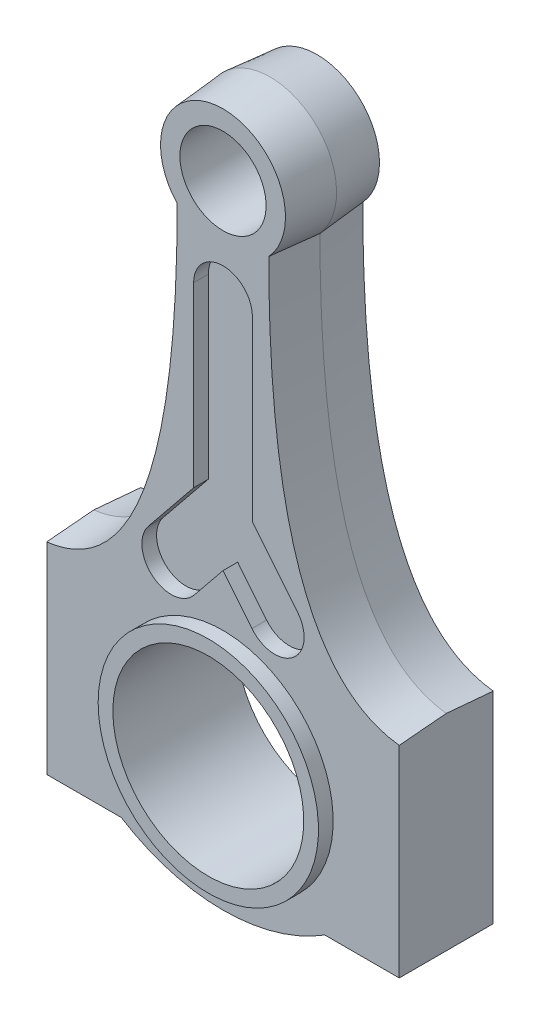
ISO-10303-21;
HEADER;
FILE_DESCRIPTION(('STEP AP214'),'2;1');
FILE_NAME('part.step','',(''),(''),'','','');
FILE_SCHEMA(('AUTOMOTIVE_DESIGN { 1 0 10303 214 1 1 1 1 }'));
ENDSEC;
DATA;
#1=APPLICATION_CONTEXT('core data for automotive mechanical design processes');
#2=APPLICATION_PROTOCOL_DEFINITION('international standard','automotive_design',2000,#1);
#3=PRODUCT_CONTEXT('',#1,'mechanical');
#4=PRODUCT('Part','Part','',(#3));
#5=PRODUCT_RELATED_PRODUCT_CATEGORY('part','',(#4));
#6=PRODUCT_DEFINITION_FORMATION('','',#4);
#7=PRODUCT_DEFINITION_CONTEXT('part definition',#1,'design');
#8=PRODUCT_DEFINITION('design','',#6,#7);
#9=PRODUCT_DEFINITION_SHAPE('','',#8);
#10=(LENGTH_UNIT() NAMED_UNIT(*) SI_UNIT(.MILLI.,.METRE.));
#11=(NAMED_UNIT(*) PLANE_ANGLE_UNIT() SI_UNIT($,.RADIAN.));
#12=(NAMED_UNIT(*) SI_UNIT($,.STERADIAN.) SOLID_ANGLE_UNIT());
#13=UNCERTAINTY_MEASURE_WITH_UNIT(LENGTH_MEASURE(1.E-05),#10,'distance_accuracy_value','');
#14=(GEOMETRIC_REPRESENTATION_CONTEXT(3) GLOBAL_UNCERTAINTY_ASSIGNED_CONTEXT((#13)) GLOBAL_UNIT_ASSIGNED_CONTEXT((#10,
#11,#12)) REPRESENTATION_CONTEXT('',''));
#15=CARTESIAN_POINT('',(0.,0.,0.));
#16=DIRECTION('',(0.,0.,1.));
#17=DIRECTION('',(1.,0.,0.));
#18=AXIS2_PLACEMENT_3D('',#15,#16,#17);
#19=CARTESIAN_POINT('',(0.,0.,21.));
#20=DIRECTION('',(0.,0.,1.));
#21=DIRECTION('',(1.,0.,0.));
#22=AXIS2_PLACEMENT_3D('',#19,#20,#21);
#23=PLANE('',#22);
#24=CARTESIAN_POINT('',(0.,0.,21.));
#25=DIRECTION('',(0.,0.,1.));
#26=DIRECTION('',(1.,0.,0.));
#27=AXIS2_PLACEMENT_3D('',#24,#25,#26);
#28=CIRCLE('',#27,37.5);
#29=CARTESIAN_POINT('',(-37.5,0.,21.));
#30=VERTEX_POINT('',#29);
#31=EDGE_CURVE('E600',#30,#30,#28,.T.);
#32=ORIENTED_EDGE('',*,*,#31,.T.);
#33=EDGE_LOOP('',(#32));
#34=FACE_BOUND('',#33,.T.);
#35=CARTESIAN_POINT('',(0.,0.,21.));
#36=DIRECTION('',(0.,0.,1.));
#37=DIRECTION('',(1.,0.,0.));
#38=AXIS2_PLACEMENT_3D('',#35,#36,#37);
#39=CIRCLE('',#38,32.5);
#40=CARTESIAN_POINT('',(-32.5,0.,21.));
#41=VERTEX_POINT('',#40);
#42=EDGE_CURVE('E371',#41,#41,#39,.T.);
#43=ORIENTED_EDGE('',*,*,#42,.F.);
#44=EDGE_LOOP('',(#43));
#45=FACE_BOUND('',#44,.T.);
#46=ADVANCED_FACE('F105',(#34,#45),#23,.T.);
#47=CARTESIAN_POINT('',(27.75,67.5,16.));
#48=DIRECTION('',(0.,0.,1.));
#49=DIRECTION('',(1.,0.,0.));
#50=AXIS2_PLACEMENT_3D('',#47,#48,#49);
#51=PLANE('',#50);
#52=CARTESIAN_POINT('',(0.,0.,16.));
#53=DIRECTION('',(0.,0.,1.));
#54=DIRECTION('',(1.,0.,0.));
#55=AXIS2_PLACEMENT_3D('',#52,#53,#54);
#56=CIRCLE('',#55,37.5);
#57=CARTESIAN_POINT('',(-37.5,0.,16.));
#58=VERTEX_POINT('',#57);
#59=EDGE_CURVE('E255',#58,#58,#56,.F.);
#60=ORIENTED_EDGE('',*,*,#59,.T.);
#61=EDGE_LOOP('',(#60));
#62=FACE_BOUND('',#61,.T.);
#63=CARTESIAN_POINT('',(60.,33.5907498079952,16.));
#64=CARTESIAN_POINT('',(59.949334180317,33.5966414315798,16.));
#65=CARTESIAN_POINT('',(59.8986651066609,33.6025077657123,16.));
#66=CARTESIAN_POINT('',(59.7973384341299,33.6143402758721,16.));
#67=CARTESIAN_POINT('',(59.7466808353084,33.620306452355,16.));
#68=CARTESIAN_POINT('',(59.5947537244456,33.6385802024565,16.));
#69=CARTESIAN_POINT('',(59.4935290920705,33.6512630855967,16.));
#70=CARTESIAN_POINT('',(59.1900283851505,33.6906634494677,16.));
#71=CARTESIAN_POINT('',(58.9879276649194,33.7187324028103,16.));
#72=CARTESIAN_POINT('',(58.3823380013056,33.8085240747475,16.));
#73=CARTESIAN_POINT('',(57.9796598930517,33.8758207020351,16.));
#74=CARTESIAN_POINT('',(57.1770699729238,34.0254335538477,16.));
#75=CARTESIAN_POINT('',(56.777158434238,34.1077512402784,16.));
#76=CARTESIAN_POINT('',(55.9807540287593,34.2875637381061,16.));
#77=CARTESIAN_POINT('',(55.5842611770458,34.3850586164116,16.));
#78=CARTESIAN_POINT('',(54.7967825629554,34.594903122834,16.));
#79=CARTESIAN_POINT('',(54.4057819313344,34.7071969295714,16.));
#80=CARTESIAN_POINT('',(53.6284706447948,34.9468917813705,16.));
#81=CARTESIAN_POINT('',(53.242159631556,35.0742916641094,16.));
#82=CARTESIAN_POINT('',(52.4748309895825,35.3441072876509,16.));
#83=CARTESIAN_POINT('',(52.0938131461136,35.4865224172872,16.));
#84=CARTESIAN_POINT('',(51.3376610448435,35.7861859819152,16.));
#85=CARTESIAN_POINT('',(50.9625268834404,35.9434346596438,16.));
#86=CARTESIAN_POINT('',(50.0333744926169,36.354532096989,16.));
#87=CARTESIAN_POINT('',(49.4833507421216,36.6174758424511,16.));
#88=CARTESIAN_POINT('',(48.3994410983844,37.174899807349,16.));
#89=CARTESIAN_POINT('',(47.8655581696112,37.4693857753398,16.));
#90=CARTESIAN_POINT('',(46.8153659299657,38.0881406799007,16.));
#91=CARTESIAN_POINT('',(46.2990562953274,38.4124090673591,16.));
#92=CARTESIAN_POINT('',(45.2848826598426,39.0889257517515,16.));
#93=CARTESIAN_POINT('',(44.787024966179,39.4411834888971,16.));
#94=CARTESIAN_POINT('',(43.8106488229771,40.1715159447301,16.));
#95=CARTESIAN_POINT('',(43.332130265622,40.5495905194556,16.));
#96=CARTESIAN_POINT('',(42.3948021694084,41.3294400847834,16.));
#97=CARTESIAN_POINT('',(41.9359942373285,41.7312170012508,16.));
#98=CARTESIAN_POINT('',(40.8597469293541,42.7204449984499,16.));
#99=CARTESIAN_POINT('',(40.2517600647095,43.3182092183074,16.));
#100=CARTESIAN_POINT('',(39.0738705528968,44.5504117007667,16.));
#101=CARTESIAN_POINT('',(38.5039829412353,45.1848642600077,16.));
#102=CARTESIAN_POINT('',(37.4011832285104,46.4851555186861,16.));
#103=CARTESIAN_POINT('',(36.8682750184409,47.1509975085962,16.));
#104=CARTESIAN_POINT('',(35.8364205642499,48.5111904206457,16.));
#105=CARTESIAN_POINT('',(35.3375681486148,49.2056122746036,16.));
#106=CARTESIAN_POINT('',(34.3734377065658,50.6171328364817,16.));
#107=CARTESIAN_POINT('',(33.9081537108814,51.3342274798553,16.));
#108=CARTESIAN_POINT('',(33.0089054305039,52.7877686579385,16.));
#109=CARTESIAN_POINT('',(32.574942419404,53.5242159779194,16.));
#110=CARTESIAN_POINT('',(31.6853717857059,55.1037540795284,16.));
#111=CARTESIAN_POINT('',(31.2335140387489,55.9489533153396,16.));
#112=CARTESIAN_POINT('',(30.3634930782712,57.656774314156,16.));
#113=CARTESIAN_POINT('',(29.9453401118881,58.519401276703,16.));
#114=CARTESIAN_POINT('',(29.1399322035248,60.2594757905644,16.));
#115=CARTESIAN_POINT('',(28.7526938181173,61.1369309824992,16.));
#116=CARTESIAN_POINT('',(28.0066882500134,62.9042049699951,16.));
#117=CARTESIAN_POINT('',(27.6479315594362,63.7940281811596,16.));
#118=CARTESIAN_POINT('',(26.9567557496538,65.5837111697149,16.));
#119=CARTESIAN_POINT('',(26.6243339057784,66.483569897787,16.));
#120=CARTESIAN_POINT('',(25.981422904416,68.2981123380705,16.));
#121=CARTESIAN_POINT('',(25.671102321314,69.2128556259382,16.));
#122=CARTESIAN_POINT('',(25.0731904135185,71.0492572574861,16.));
#123=CARTESIAN_POINT('',(24.7855887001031,71.9709122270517,16.));
#124=CARTESIAN_POINT('',(24.2313038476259,73.8202527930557,16.));
#125=CARTESIAN_POINT('',(23.9646160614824,74.7479369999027,16.));
#126=CARTESIAN_POINT('',(23.450570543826,76.6085149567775,16.));
#127=CARTESIAN_POINT('',(23.2032105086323,77.5414080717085,16.));
#128=CARTESIAN_POINT('',(22.7264182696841,79.4116341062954,16.));
#129=CARTESIAN_POINT('',(22.4969839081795,80.3489664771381,16.));
#130=CARTESIAN_POINT('',(22.0326454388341,82.3214251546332,16.));
#131=CARTESIAN_POINT('',(21.7994867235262,83.356961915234,16.));
#132=CARTESIAN_POINT('',(21.3517763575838,85.4320668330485,16.));
#133=CARTESIAN_POINT('',(21.1372251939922,86.4716350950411,16.));
#134=CARTESIAN_POINT('',(20.7253488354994,88.5543414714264,16.));
#135=CARTESIAN_POINT('',(20.528026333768,89.5974801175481,16.));
#136=CARTESIAN_POINT('',(20.1494303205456,91.6866721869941,16.));
#137=CARTESIAN_POINT('',(19.9681570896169,92.7327256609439,16.));
#138=CARTESIAN_POINT('',(19.4465002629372,95.8760457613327,16.));
#139=CARTESIAN_POINT('',(19.1285552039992,97.9770613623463,16.));
#140=CARTESIAN_POINT('',(18.5446280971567,102.188044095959,16.));
#141=CARTESIAN_POINT('',(18.2786909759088,104.298017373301,16.));
#142=CARTESIAN_POINT('',(17.7928444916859,108.52484381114,16.));
#143=CARTESIAN_POINT('',(17.5729701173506,110.641700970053,16.));
#144=CARTESIAN_POINT('',(17.1743181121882,114.880291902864,16.));
#145=CARTESIAN_POINT('',(16.9955606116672,117.002027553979,16.));
#146=CARTESIAN_POINT('',(16.6823996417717,121.150088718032,16.));
#147=CARTESIAN_POINT('',(16.546327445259,123.176289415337,16.));
#148=CARTESIAN_POINT('',(16.304664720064,127.229796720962,16.));
#149=CARTESIAN_POINT('',(16.1990637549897,129.257102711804,16.));
#150=CARTESIAN_POINT('',(16.0156423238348,133.311043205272,16.));
#151=CARTESIAN_POINT('',(15.9377957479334,135.337676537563,16.));
#152=CARTESIAN_POINT('',(15.8074933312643,139.388503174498,16.));
#153=CARTESIAN_POINT('',(15.7549970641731,141.412695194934,16.));
#154=CARTESIAN_POINT('',(15.6732589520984,145.456883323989,16.));
#155=CARTESIAN_POINT('',(15.643963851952,147.476878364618,16.));
#156=CARTESIAN_POINT('',(15.6159993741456,150.503934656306,16.));
#157=CARTESIAN_POINT('',(15.6093389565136,151.510929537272,16.));
#158=CARTESIAN_POINT('',(15.603169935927,153.021435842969,16.));
#159=CARTESIAN_POINT('',(15.6017505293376,153.52493955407,16.));
#160=CARTESIAN_POINT('',(15.600548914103,154.280196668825,16.));
#161=CARTESIAN_POINT('',(15.6003029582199,154.53194939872,16.));
#162=CARTESIAN_POINT('',(15.6001775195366,154.909578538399,16.));
#163=CARTESIAN_POINT('',(15.6001762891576,155.035454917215,16.));
#164=CARTESIAN_POINT('',(15.6001864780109,155.287207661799,16.));
#165=CARTESIAN_POINT('',(15.6001978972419,155.413084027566,16.));
#166=CARTESIAN_POINT('',(15.600181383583,155.538960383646,16.));
#167=B_SPLINE_CURVE_WITH_KNOTS('',3,(#63,#64,#65,#66,#67,#68,#69,#70,#71,#72,#73,#74,#75,#76,
#77,#78,#79,#80,#81,#82,#83,#84,#85,#86,#87,#88,#89,#90,#91,#92,#93,#94,#95,#96,#97,#98,#99,
#100,#101,#102,#103,#104,#105,#106,#107,#108,#109,#110,#111,#112,#113,#114,#115,#116,#117,#118,
#119,#120,#121,#122,#123,#124,#125,#126,#127,#128,#129,#130,#131,#132,#133,#134,#135,#136,#137,
#138,#139,#140,#141,#142,#143,#144,#145,#146,#147,#148,#149,#150,#151,#152,#153,#154,#155,#156,
#157,#158,#159,#160,#161,#162,#163,#164,#165,#166),.UNSPECIFIED.,.F.,.F.,(4,2,2,2,2,2,2,2,2,2,2,
2,2,2,2,2,2,2,2,2,2,2,2,2,2,2,2,2,2,2,2,2,2,2,2,2,2,2,2,2,2,2,2,2,2,2,2,2,2,2,2,4),(0.,
0.153022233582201,0.306045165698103,0.612088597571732,1.22418199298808,2.4486654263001,
3.67326809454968,4.89787616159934,6.11799060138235,7.33801122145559,8.5579822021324,
9.77797314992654,11.6057949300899,13.4339503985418,15.2620721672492,17.0908131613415,
18.9195439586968,20.7484235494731,23.3044068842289,25.8613930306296,28.4186478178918,
30.9826853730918,33.5462658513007,36.1099505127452,38.9843086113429,41.859537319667,
44.7362956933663,47.6141089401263,50.4916240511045,53.3891471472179,56.2853375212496,
59.1808825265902,62.0760818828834,64.9709321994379,68.1551259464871,71.339403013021,
74.5241769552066,77.7090065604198,84.0829762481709,90.462427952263,96.8467079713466,
103.23410703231,109.326151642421,115.416107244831,121.500318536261,127.57479498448,
133.635287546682,136.656327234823,138.166842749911,138.922101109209,139.299730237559,
139.677359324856),.UNSPECIFIED.);
#168=CARTESIAN_POINT('',(60.,33.5907498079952,16.));
#169=VERTEX_POINT('',#168);
#170=CARTESIAN_POINT('',(15.6001813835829,155.538960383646,16.));
#171=VERTEX_POINT('',#170);
#172=EDGE_CURVE('E251',#169,#171,#167,.T.);
#173=ORIENTED_EDGE('',*,*,#172,.T.);
#174=CARTESIAN_POINT('',(0.,170.,16.));
#175=DIRECTION('',(0.,0.,1.));
#176=DIRECTION('',(1.,0.,0.));
#177=AXIS2_PLACEMENT_3D('',#174,#175,#176);
#178=CIRCLE('',#177,21.2717494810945);
#179=CARTESIAN_POINT('',(-15.6001813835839,155.538960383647,16.));
#180=VERTEX_POINT('',#179);
#181=EDGE_CURVE('E238',#171,#180,#178,.T.);
#182=ORIENTED_EDGE('',*,*,#181,.T.);
#183=CARTESIAN_POINT('',(-15.6001813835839,155.538960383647,16.));
#184=CARTESIAN_POINT('',(-15.6001870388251,155.378510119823,16.));
#185=CARTESIAN_POINT('',(-15.6001720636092,155.21805982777,16.));
#186=CARTESIAN_POINT('',(-15.6001907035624,154.897159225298,16.));
#187=CARTESIAN_POINT('',(-15.6002243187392,154.736708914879,16.));
#188=CARTESIAN_POINT('',(-15.6005328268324,154.25535816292,16.));
#189=CARTESIAN_POINT('',(-15.6010153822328,153.934457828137,16.));
#190=CARTESIAN_POINT('',(-15.6032138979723,152.971758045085,16.));
#191=CARTESIAN_POINT('',(-15.6056807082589,152.329960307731,16.));
#192=CARTESIAN_POINT('',(-15.6162240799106,150.404380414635,16.));
#193=CARTESIAN_POINT('',(-15.6274437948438,149.12061378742,16.));
#194=CARTESIAN_POINT('',(-15.6586598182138,146.553055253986,16.));
#195=CARTESIAN_POINT('',(-15.6786570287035,145.269263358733,16.));
#196=CARTESIAN_POINT('',(-15.7279024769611,142.701785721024,16.));
#197=CARTESIAN_POINT('',(-15.7571512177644,141.418099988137,16.));
#198=CARTESIAN_POINT('',(-15.8254009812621,138.850968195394,16.));
#199=CARTESIAN_POINT('',(-15.8644021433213,137.567522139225,16.));
#200=CARTESIAN_POINT('',(-15.9528594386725,134.996496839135,16.));
#201=CARTESIAN_POINT('',(-16.002351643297,133.708918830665,16.));
#202=CARTESIAN_POINT('',(-16.1123110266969,131.134268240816,16.));
#203=CARTESIAN_POINT('',(-16.1727778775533,129.847195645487,16.));
#204=CARTESIAN_POINT('',(-16.3053461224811,127.273692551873,16.));
#205=CARTESIAN_POINT('',(-16.3774471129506,125.987262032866,16.));
#206=CARTESIAN_POINT('',(-16.5340078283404,123.415182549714,16.));
#207=CARTESIAN_POINT('',(-16.6184672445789,122.129533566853,16.));
#208=CARTESIAN_POINT('',(-16.8005444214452,119.559163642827,16.));
#209=CARTESIAN_POINT('',(-16.8981622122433,118.274442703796,16.));
#210=CARTESIAN_POINT('',(-17.1337157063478,115.383585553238,16.));
#211=CARTESIAN_POINT('',(-17.2756196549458,113.777769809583,16.));
#212=CARTESIAN_POINT('',(-17.583330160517,110.568384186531,16.));
#213=CARTESIAN_POINT('',(-17.7491372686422,108.964814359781,16.));
#214=CARTESIAN_POINT('',(-18.1068755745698,105.760494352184,16.));
#215=CARTESIAN_POINT('',(-18.2988081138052,104.159744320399,16.));
#216=CARTESIAN_POINT('',(-18.7113175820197,100.961671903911,16.));
#217=CARTESIAN_POINT('',(-18.9318989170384,99.3643500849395,16.));
#218=CARTESIAN_POINT('',(-19.4046485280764,96.1745086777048,16.));
#219=CARTESIAN_POINT('',(-19.6568140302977,94.5819886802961,16.));
#220=CARTESIAN_POINT('',(-20.1962079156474,91.4028890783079,16.));
#221=CARTESIAN_POINT('',(-20.4834358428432,89.8163093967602,16.));
#222=CARTESIAN_POINT('',(-21.0969489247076,86.6509910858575,16.));
#223=CARTESIAN_POINT('',(-21.4232267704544,85.0722510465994,16.));
#224=CARTESIAN_POINT('',(-22.1195867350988,81.9246353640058,16.));
#225=CARTESIAN_POINT('',(-22.4896625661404,80.3557583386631,16.));
#226=CARTESIAN_POINT('',(-23.2289667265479,77.4295662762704,16.));
#227=CARTESIAN_POINT('',(-23.5922952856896,76.0707645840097,16.));
#228=CARTESIAN_POINT('',(-24.3610135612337,73.3649972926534,16.));
#229=CARTESIAN_POINT('',(-24.7664047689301,72.0180321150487,16.));
#230=CARTESIAN_POINT('',(-25.6244253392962,69.3387062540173,16.));
#231=CARTESIAN_POINT('',(-26.0770690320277,68.0063501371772,16.));
#232=CARTESIAN_POINT('',(-27.0347619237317,65.3626391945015,16.));
#233=CARTESIAN_POINT('',(-27.5397354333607,64.0512571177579,16.));
#234=CARTESIAN_POINT('',(-28.6095031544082,61.4533429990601,16.));
#235=CARTESIAN_POINT('',(-29.1742839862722,60.1668054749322,16.));
#236=CARTESIAN_POINT('',(-30.3714616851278,57.626044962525,16.));
#237=CARTESIAN_POINT('',(-31.0038237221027,56.37180573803,16.));
#238=CARTESIAN_POINT('',(-32.053152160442,54.4418115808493,16.));
#239=CARTESIAN_POINT('',(-32.4440909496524,53.7518505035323,16.));
#240=CARTESIAN_POINT('',(-33.2520797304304,52.3873668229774,16.));
#241=CARTESIAN_POINT('',(-33.6691286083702,51.7128435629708,16.));
#242=CARTESIAN_POINT('',(-34.5311119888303,50.3817083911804,16.));
#243=CARTESIAN_POINT('',(-34.9760495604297,49.7250984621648,16.));
#244=CARTESIAN_POINT('',(-35.8948099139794,48.4337310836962,16.));
#245=CARTESIAN_POINT('',(-36.3685913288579,47.7989442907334,16.));
#246=CARTESIAN_POINT('',(-37.3471152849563,46.5536911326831,16.));
#247=CARTESIAN_POINT('',(-37.8518561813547,45.9432234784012,16.));
#248=CARTESIAN_POINT('',(-38.8935250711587,44.7504898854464,16.));
#249=CARTESIAN_POINT('',(-39.430446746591,44.1682184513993,16.));
#250=CARTESIAN_POINT('',(-40.429923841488,43.1460028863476,16.));
#251=CARTESIAN_POINT('',(-40.8866730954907,42.7003776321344,16.));
#252=CARTESIAN_POINT('',(-41.8219176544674,41.8325470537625,16.));
#253=CARTESIAN_POINT('',(-42.3004119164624,41.4103406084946,16.));
#254=CARTESIAN_POINT('',(-43.2790376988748,40.5917271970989,16.));
#255=CARTESIAN_POINT('',(-43.7791697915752,40.1953209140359,16.));
#256=CARTESIAN_POINT('',(-44.7999805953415,39.4312388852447,16.));
#257=CARTESIAN_POINT('',(-45.3206328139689,39.0635278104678,16.));
#258=CARTESIAN_POINT('',(-46.382251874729,38.3586463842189,16.));
#259=CARTESIAN_POINT('',(-46.9232190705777,38.0214765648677,16.));
#260=CARTESIAN_POINT('',(-48.0241899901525,37.3799019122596,16.));
#261=CARTESIAN_POINT('',(-48.5841908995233,37.0754922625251,16.));
#262=CARTESIAN_POINT('',(-49.5801880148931,36.572733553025,16.));
#263=CARTESIAN_POINT('',(-50.0123907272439,36.3668344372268,16.));
#264=CARTESIAN_POINT('',(-50.8858822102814,35.9751656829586,16.));
#265=CARTESIAN_POINT('',(-51.3271717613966,35.789397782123,16.));
#266=CARTESIAN_POINT('',(-52.2179073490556,35.4384174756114,16.));
#267=CARTESIAN_POINT('',(-52.6673543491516,35.2732075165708,16.));
#268=CARTESIAN_POINT('',(-53.5734391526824,34.9636184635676,16.));
#269=CARTESIAN_POINT('',(-54.0300779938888,34.8192424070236,16.));
#270=CARTESIAN_POINT('',(-54.9533311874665,34.5503346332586,16.));
#271=CARTESIAN_POINT('',(-55.4199971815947,34.4259804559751,16.));
#272=CARTESIAN_POINT('',(-56.3584972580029,34.1985517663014,16.));
#273=CARTESIAN_POINT('',(-56.8303313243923,34.0954771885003,16.));
#274=CARTESIAN_POINT('',(-57.5410968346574,33.9566870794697,16.));
#275=CARTESIAN_POINT('',(-57.7785126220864,33.9130619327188,16.));
#276=CARTESIAN_POINT('',(-58.2542552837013,33.8310379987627,16.));
#277=CARTESIAN_POINT('',(-58.4925821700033,33.7926392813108,16.));
#278=CARTESIAN_POINT('',(-58.8505954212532,33.7389367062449,16.));
#279=CARTESIAN_POINT('',(-58.9699940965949,33.7216884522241,16.));
#280=CARTESIAN_POINT('',(-59.2089722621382,33.6884797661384,16.));
#281=CARTESIAN_POINT('',(-59.3285517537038,33.6725193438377,16.));
#282=CARTESIAN_POINT('',(-59.5080404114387,33.6495387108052,16.));
#283=CARTESIAN_POINT('',(-59.5678886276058,33.6420386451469,16.));
#284=CARTESIAN_POINT('',(-59.6876249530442,33.6273596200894,16.));
#285=CARTESIAN_POINT('',(-59.7475130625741,33.6201806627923,16.));
#286=CARTESIAN_POINT('',(-59.8373717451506,33.6096455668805,16.));
#287=CARTESIAN_POINT('',(-59.8673287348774,33.6061727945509,16.));
#288=CARTESIAN_POINT('',(-59.9272411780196,33.5992140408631,16.));
#289=CARTESIAN_POINT('',(-59.9571966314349,33.5957280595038,16.));
#290=CARTESIAN_POINT('',(-60.0171074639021,33.5887594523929,16.));
#291=CARTESIAN_POINT('',(-60.0470628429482,33.5852768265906,16.));
#292=CARTESIAN_POINT('',(-60.1069735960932,33.5783115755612,16.));
#293=CARTESIAN_POINT('',(-60.1369289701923,33.5748289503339,16.));
#294=CARTESIAN_POINT('',(-60.1668841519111,33.5713446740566,16.));
#295=B_SPLINE_CURVE_WITH_KNOTS('',3,(#183,#184,#185,#186,#187,#188,#189,#190,#191,#192,#193,
#194,#195,#196,#197,#198,#199,#200,#201,#202,#203,#204,#205,#206,#207,#208,#209,#210,#211,#212,
#213,#214,#215,#216,#217,#218,#219,#220,#221,#222,#223,#224,#225,#226,#227,#228,#229,#230,#231,
#232,#233,#234,#235,#236,#237,#238,#239,#240,#241,#242,#243,#244,#245,#246,#247,#248,#249,#250,
#251,#252,#253,#254,#255,#256,#257,#258,#259,#260,#261,#262,#263,#264,#265,#266,#267,#268,#269,
#270,#271,#272,#273,#274,#275,#276,#277,#278,#279,#280,#281,#282,#283,#284,#285,#286,#287,#288,
#289,#290,#291,#292,#293,#294),.UNSPECIFIED.,.F.,.F.,(4,2,2,2,2,2,2,2,2,2,2,2,2,2,2,2,2,2,2,2,2,
2,2,2,2,2,2,2,2,2,2,2,2,2,2,2,2,2,2,2,2,2,2,2,2,2,2,2,2,2,2,2,2,2,2,4),(0.,0.48135084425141,
0.962701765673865,1.92540339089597,3.85080811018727,7.70222416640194,11.5540361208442,
15.4060575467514,19.2581340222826,23.1236763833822,26.9891032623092,30.8543960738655,
34.7195923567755,38.5847975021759,43.4208496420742,48.2570133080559,53.093425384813,
57.9305821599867,62.7673144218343,67.603983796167,72.4397493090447,77.2748214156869,
81.4938468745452,85.7130219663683,89.9334803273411,94.1479172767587,98.3614133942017,
102.572748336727,104.951322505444,107.329795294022,109.708530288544,112.08393065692,
114.459204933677,116.834014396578,118.747656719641,120.661207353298,122.574808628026,
124.486015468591,126.397255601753,128.308214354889,129.74396143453,131.179832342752,
132.615873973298,134.052124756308,135.500482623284,136.948836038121,137.672961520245,
138.397096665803,138.759005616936,139.120917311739,139.301865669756,139.482815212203,
139.573288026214,139.663760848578,139.754232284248,139.844703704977),.UNSPECIFIED.);
#296=CARTESIAN_POINT('',(-60.,33.5907498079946,16.));
#297=VERTEX_POINT('',#296);
#298=EDGE_CURVE('E155',#180,#297,#295,.T.);
#299=ORIENTED_EDGE('',*,*,#298,.T.);
#300=DIRECTION('',(0.,-1.,0.));
#301=VECTOR('',#300,1.);
#302=CARTESIAN_POINT('',(-60.,-35.,16.));
#303=LINE('',#302,#301);
#304=CARTESIAN_POINT('',(-60.,-35.,16.));
#305=VERTEX_POINT('',#304);
#306=EDGE_CURVE('E161',#297,#305,#303,.T.);
#307=ORIENTED_EDGE('',*,*,#306,.T.);
#308=DIRECTION('',(1.,0.,0.));
#309=VECTOR('',#308,1.);
#310=CARTESIAN_POINT('',(-60.,-35.,16.));
#311=LINE('',#310,#309);
#312=CARTESIAN_POINT('',(-34.6410161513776,-35.,16.));
#313=VERTEX_POINT('',#312);
#314=EDGE_CURVE('E178',#305,#313,#311,.T.);
#315=ORIENTED_EDGE('',*,*,#314,.T.);
#316=CARTESIAN_POINT('',(0.,20.,16.));
#317=DIRECTION('',(0.,0.,1.));
#318=DIRECTION('',(1.,0.,0.));
#319=AXIS2_PLACEMENT_3D('',#316,#317,#318);
#320=CIRCLE('',#319,65.);
#321=CARTESIAN_POINT('',(34.6410161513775,-35.,16.));
#322=VERTEX_POINT('',#321);
#323=EDGE_CURVE('E170',#313,#322,#320,.T.);
#324=ORIENTED_EDGE('',*,*,#323,.T.);
#325=DIRECTION('',(1.,0.,0.));
#326=VECTOR('',#325,1.);
#327=CARTESIAN_POINT('',(34.6410161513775,-35.,16.));
#328=LINE('',#327,#326);
#329=CARTESIAN_POINT('',(60.,-35.,16.));
#330=VERTEX_POINT('',#329);
#331=EDGE_CURVE('E175',#322,#330,#328,.T.);
#332=ORIENTED_EDGE('',*,*,#331,.T.);
#333=DIRECTION('',(0.,1.,0.));
#334=VECTOR('',#333,1.);
#335=CARTESIAN_POINT('',(60.,-35.,16.));
#336=LINE('',#335,#334);
#337=EDGE_CURVE('E138',#330,#169,#336,.T.);
#338=ORIENTED_EDGE('',*,*,#337,.T.);
#339=EDGE_LOOP('',(#173,#182,#299,#307,#315,#324,#332,#338));
#340=FACE_BOUND('',#339,.T.);
#341=DIRECTION('',(0.,-1.,0.));
#342=VECTOR('',#341,1.);
#343=CARTESIAN_POINT('',(-10.,67.5,16.));
#344=LINE('',#343,#342);
#345=CARTESIAN_POINT('',(-10.,135.,16.));
#346=VERTEX_POINT('',#345);
#347=CARTESIAN_POINT('',(-10.,74.541185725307,16.));
#348=VERTEX_POINT('',#347);
#349=EDGE_CURVE('E575',#346,#348,#344,.T.);
#350=ORIENTED_EDGE('',*,*,#349,.F.);
#351=CARTESIAN_POINT('',(0.,135.,16.));
#352=DIRECTION('',(0.,0.,1.));
#353=DIRECTION('',(1.,0.,0.));
#354=AXIS2_PLACEMENT_3D('',#351,#352,#353);
#355=CIRCLE('',#354,10.);
#356=CARTESIAN_POINT('',(10.,135.,16.));
#357=VERTEX_POINT('',#356);
#358=EDGE_CURVE('E581',#357,#346,#355,.T.);
#359=ORIENTED_EDGE('',*,*,#358,.F.);
#360=DIRECTION('',(0.,-1.,0.));
#361=VECTOR('',#360,1.);
#362=CARTESIAN_POINT('',(10.,67.5,16.));
#363=LINE('',#362,#361);
#364=CARTESIAN_POINT('',(10.,74.541185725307,16.));
#365=VERTEX_POINT('',#364);
#366=EDGE_CURVE('E571',#357,#365,#363,.T.);
#367=ORIENTED_EDGE('',*,*,#366,.T.);
#368=DIRECTION('',(-0.629320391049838,0.777145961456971,0.));
#369=VECTOR('',#368,1.);
#370=CARTESIAN_POINT('',(20.4734432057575,61.6075604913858,16.));
#371=LINE('',#370,#369);
#372=CARTESIAN_POINT('',(25.3924305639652,55.5331169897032,16.));
#373=VERTEX_POINT('',#372);
#374=EDGE_CURVE('E632',#373,#365,#371,.T.);
#375=ORIENTED_EDGE('',*,*,#374,.F.);
#376=CARTESIAN_POINT('',(17.6209709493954,49.2399130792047,16.));
#377=DIRECTION('',(0.,0.,1.));
#378=DIRECTION('',(1.,0.,0.));
#379=AXIS2_PLACEMENT_3D('',#376,#377,#378);
#380=CIRCLE('',#379,10.);
#381=CARTESIAN_POINT('',(9.84951133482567,42.9467091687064,16.));
#382=VERTEX_POINT('',#381);
#383=EDGE_CURVE('E630',#382,#373,#380,.T.);
#384=ORIENTED_EDGE('',*,*,#383,.F.);
#385=DIRECTION('',(-0.629320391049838,0.777145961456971,0.));
#386=VECTOR('',#385,1.);
#387=CARTESIAN_POINT('',(4.93052397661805,49.021152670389,16.));
#388=LINE('',#387,#386);
#389=CARTESIAN_POINT('',(0.,55.1098427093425,16.));
#390=VERTEX_POINT('',#389);
#391=EDGE_CURVE('E587',#382,#390,#388,.T.);
#392=ORIENTED_EDGE('',*,*,#391,.T.);
#393=DIRECTION('',(0.629320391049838,0.777145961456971,0.));
#394=VECTOR('',#393,1.);
#395=CARTESIAN_POINT('',(17.0499266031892,76.1647485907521,16.));
#396=LINE('',#395,#394);
#397=CARTESIAN_POINT('',(-9.84951133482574,42.9467091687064,16.));
#398=VERTEX_POINT('',#397);
#399=EDGE_CURVE('E623',#398,#390,#396,.T.);
#400=ORIENTED_EDGE('',*,*,#399,.F.);
#401=CARTESIAN_POINT('',(-17.6209709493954,49.2399130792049,16.));
#402=DIRECTION('',(0.,0.,1.));
#403=DIRECTION('',(1.,0.,0.));
#404=AXIS2_PLACEMENT_3D('',#401,#402,#403);
#405=CIRCLE('',#404,10.);
#406=CARTESIAN_POINT('',(-25.3924305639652,55.5331169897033,16.));
#407=VERTEX_POINT('',#406);
#408=EDGE_CURVE('E129',#407,#398,#405,.T.);
#409=ORIENTED_EDGE('',*,*,#408,.F.);
#410=DIRECTION('',(0.629320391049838,0.777145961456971,0.));
#411=VECTOR('',#410,1.);
#412=CARTESIAN_POINT('',(1.50700737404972,88.7511564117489,16.));
#413=LINE('',#412,#411);
#414=EDGE_CURVE('E591',#407,#348,#413,.T.);
#415=ORIENTED_EDGE('',*,*,#414,.T.);
#416=EDGE_LOOP('',(#350,#359,#367,#375,#384,#392,#400,#409,#415));
#417=FACE_BOUND('',#416,.T.);
#418=CARTESIAN_POINT('',(0.,170.,16.));
#419=DIRECTION('',(0.,0.,1.));
#420=DIRECTION('',(1.,0.,0.));
#421=AXIS2_PLACEMENT_3D('',#418,#419,#420);
#422=CIRCLE('',#421,14.6715680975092);
#423=CARTESIAN_POINT('',(-14.6715680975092,170.,16.));
#424=VERTEX_POINT('',#423);
#425=EDGE_CURVE('E583',#424,#424,#422,.F.);
#426=ORIENTED_EDGE('',*,*,#425,.T.);
#427=EDGE_LOOP('',(#426));
#428=FACE_BOUND('',#427,.T.);
#429=ADVANCED_FACE('F172',(#62,#340,#417,#428),#51,.T.);
#430=CARTESIAN_POINT('',(60.8600000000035,34.9000000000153,0.));
#431=CARTESIAN_POINT('',(60.5733333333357,34.9333333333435,0.));
#432=CARTESIAN_POINT('',(60.2866666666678,34.9666666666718,0.));
#433=CARTESIAN_POINT('',(60.,35.,0.));
#434=CARTESIAN_POINT('',(56.416666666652,35.4166666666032,0.));
#435=CARTESIAN_POINT('',(53.0572916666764,36.4062500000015,0.));
#436=CARTESIAN_POINT('',(46.7864583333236,39.5312499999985,0.));
#437=CARTESIAN_POINT('',(43.8750000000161,41.666666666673,0.));
#438=CARTESIAN_POINT('',(38.4999999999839,47.083333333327,0.));
#439=CARTESIAN_POINT('',(36.0364583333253,50.3645833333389,0.));
#440=CARTESIAN_POINT('',(31.5572916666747,58.0729166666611,0.));
#441=CARTESIAN_POINT('',(29.5416666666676,62.4999999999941,0.));
#442=CARTESIAN_POINT('',(24.1666666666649,77.5000000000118,0.));
#443=CARTESIAN_POINT('',(21.4791666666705,89.7916666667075,0.));
#444=CARTESIAN_POINT('',(17.8958333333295,118.958333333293,0.));
#445=CARTESIAN_POINT('',(17.0000000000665,135.833333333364,0.));
#446=CARTESIAN_POINT('',(17.,155.,0.));
#447=CARTESIAN_POINT('',(16.9999999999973,155.766666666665,0.));
#448=CARTESIAN_POINT('',(16.9999999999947,156.533333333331,0.));
#449=CARTESIAN_POINT('',(16.999999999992,157.299999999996,0.));
#450=CARTESIAN_POINT('',(60.7099628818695,33.2263459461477,19.2));
#451=CARTESIAN_POINT('',(60.4086364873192,33.2613838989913,19.2));
#452=CARTESIAN_POINT('',(60.1073100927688,33.2964218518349,19.2));
#453=CARTESIAN_POINT('',(59.8059836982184,33.3314598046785,19.2));
#454=CARTESIAN_POINT('',(56.0394037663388,33.7694342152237,19.2));
#455=CARTESIAN_POINT('',(52.4833578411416,34.8154560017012,19.2));
#456=CARTESIAN_POINT('',(45.8619463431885,38.115162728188,19.2));
#457=CARTESIAN_POINT('',(42.7989304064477,40.3662815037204,19.2));
#458=CARTESIAN_POINT('',(37.1913443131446,46.0173372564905,19.2));
#459=CARTESIAN_POINT('',(34.6448483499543,49.4160467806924,19.2));
#460=CARTESIAN_POINT('',(30.0441372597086,57.3335495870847,19.2));
#461=CARTESIAN_POINT('',(27.9890830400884,61.8531523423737,19.2));
#462=CARTESIAN_POINT('',(22.5278610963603,77.0937717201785,19.2));
#463=CARTESIAN_POINT('',(19.8227806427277,89.4984313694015,19.2));
#464=CARTESIAN_POINT('',(16.2177256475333,118.841902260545,19.2));
#465=CARTESIAN_POINT('',(15.3202176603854,135.780685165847,19.2));
#466=CARTESIAN_POINT('',(15.3202176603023,155.,19.2));
#467=CARTESIAN_POINT('',(15.3202176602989,155.768772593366,19.2));
#468=CARTESIAN_POINT('',(15.3202176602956,156.537545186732,19.2));
#469=CARTESIAN_POINT('',(15.3202176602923,157.306317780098,19.2));
#470=B_SPLINE_SURFACE_WITH_KNOTS('',1,3,((#430,#431,#432,#433,#434,#435,#436,#437,#438,#439,
#440,#441,#442,#443,#444,#445,#446,#447,#448,#449),(#450,#451,#452,#453,#454,#455,#456,#457,
#458,#459,#460,#461,#462,#463,#464,#465,#466,#467,#468,#469)),.UNSPECIFIED.,.F.,.F.,.F.,(2,2),
(4,3,2,2,2,2,2,3,4),(0.,1.),(-0.01,0.,0.125,0.25,0.375,0.5,0.75,1.,1.01),.UNSPECIFIED.);
#471=CARTESIAN_POINT('',(60.,35.,0.));
#472=CARTESIAN_POINT('',(59.5934625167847,35.0472578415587,0.));
#473=CARTESIAN_POINT('',(59.1877962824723,35.1021510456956,0.));
#474=CARTESIAN_POINT('',(58.3787562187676,35.2275088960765,0.));
#475=CARTESIAN_POINT('',(57.9753831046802,35.2979781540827,0.));
#476=CARTESIAN_POINT('',(57.1716817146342,35.454768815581,0.));
#477=CARTESIAN_POINT('',(56.7713537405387,35.5410917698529,0.));
#478=CARTESIAN_POINT('',(55.9744858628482,35.7297516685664,0.));
#479=CARTESIAN_POINT('',(55.5779459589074,35.8320886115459,0.));
#480=CARTESIAN_POINT('',(54.791311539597,36.0523005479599,0.));
#481=CARTESIAN_POINT('',(54.4011948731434,36.1700963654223,0.));
#482=CARTESIAN_POINT('',(53.6261501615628,36.4215587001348,0.));
#483=CARTESIAN_POINT('',(53.2412216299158,36.5552237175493,0.));
#484=CARTESIAN_POINT('',(52.4772133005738,36.8382756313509,0.));
#485=CARTESIAN_POINT('',(52.0981331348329,36.987661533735,0.));
#486=CARTESIAN_POINT('',(51.3464566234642,37.3018925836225,0.));
#487=CARTESIAN_POINT('',(50.9738601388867,37.4667373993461,0.));
#488=CARTESIAN_POINT('',(50.0873446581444,37.8808541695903,0.));
#489=CARTESIAN_POINT('',(49.5768176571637,38.1374291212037,0.));
#490=CARTESIAN_POINT('',(48.5710283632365,38.6790197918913,0.));
#491=CARTESIAN_POINT('',(48.075768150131,38.9640393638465,0.));
#492=CARTESIAN_POINT('',(47.1017184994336,39.560900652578,0.));
#493=CARTESIAN_POINT('',(46.6229285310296,39.8727415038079,0.));
#494=CARTESIAN_POINT('',(45.6824230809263,40.5216107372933,0.));
#495=CARTESIAN_POINT('',(45.2207158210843,40.8586510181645,0.));
#496=CARTESIAN_POINT('',(44.3151435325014,41.5558738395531,0.));
#497=CARTESIAN_POINT('',(43.8712785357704,41.9160564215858,0.));
#498=CARTESIAN_POINT('',(43.0016028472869,42.6576317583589,0.));
#499=CARTESIAN_POINT('',(42.5757938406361,43.0390264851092,0.));
#500=CARTESIAN_POINT('',(41.7011242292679,43.8596642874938,0.));
#501=CARTESIAN_POINT('',(41.2541350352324,44.3009019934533,0.));
#502=CARTESIAN_POINT('',(40.3816520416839,45.2041888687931,0.));
#503=CARTESIAN_POINT('',(39.956161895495,45.6662415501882,0.));
#504=CARTESIAN_POINT('',(38.7109793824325,47.0803734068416,0.));
#505=CARTESIAN_POINT('',(37.9226997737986,48.0603077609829,0.));
#506=CARTESIAN_POINT('',(36.4223004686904,50.0804335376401,0.));
#507=CARTESIAN_POINT('',(35.7104029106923,51.1207878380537,0.));
#508=CARTESIAN_POINT('',(34.357803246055,53.2464593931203,0.));
#509=CARTESIAN_POINT('',(33.7170954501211,54.3317730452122,0.));
#510=CARTESIAN_POINT('',(32.6433952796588,56.2767205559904,0.));
#511=CARTESIAN_POINT('',(32.1970937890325,57.1290859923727,0.));
#512=CARTESIAN_POINT('',(31.3384376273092,58.8510637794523,0.));
#513=CARTESIAN_POINT('',(30.9260938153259,59.7206815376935,0.));
#514=CARTESIAN_POINT('',(30.1324252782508,61.4744802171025,0.));
#515=CARTESIAN_POINT('',(29.7511177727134,62.358668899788,0.));
#516=CARTESIAN_POINT('',(29.0169945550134,64.1391539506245,0.));
#517=CARTESIAN_POINT('',(28.6641896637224,65.0354547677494,0.));
#518=CARTESIAN_POINT('',(27.984880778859,66.8378342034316,0.));
#519=CARTESIAN_POINT('',(27.6583740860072,67.743911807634,0.));
#520=CARTESIAN_POINT('',(27.0273825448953,69.5704301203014,0.));
#521=CARTESIAN_POINT('',(26.7230586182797,70.4909262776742,0.));
#522=CARTESIAN_POINT('',(26.137021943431,72.3385908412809,0.));
#523=CARTESIAN_POINT('',(25.8552985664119,73.2657558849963,0.));
#524=CARTESIAN_POINT('',(25.3126106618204,75.1258957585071,0.));
#525=CARTESIAN_POINT('',(25.0516413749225,76.0588692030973,0.));
#526=CARTESIAN_POINT('',(24.5488495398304,77.9298296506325,0.));
#527=CARTESIAN_POINT('',(24.3070246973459,78.8678160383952,0.));
#528=CARTESIAN_POINT('',(23.841106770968,80.7480596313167,0.));
#529=CARTESIAN_POINT('',(23.6170116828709,81.6903163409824,0.));
#530=CARTESIAN_POINT('',(23.1708709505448,83.641505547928,0.));
#531=CARTESIAN_POINT('',(22.9499572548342,84.6506965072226,0.));
#532=CARTESIAN_POINT('',(22.5254520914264,86.6727299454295,0.));
#533=CARTESIAN_POINT('',(22.321861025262,87.6855725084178,0.));
#534=CARTESIAN_POINT('',(21.930745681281,89.7145059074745,0.));
#535=CARTESIAN_POINT('',(21.7432237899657,90.7305972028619,0.));
#536=CARTESIAN_POINT('',(21.3831785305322,92.7654393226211,0.));
#537=CARTESIAN_POINT('',(21.2106554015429,93.7841901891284,0.));
#538=CARTESIAN_POINT('',(20.7138558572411,96.8451294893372,0.));
#539=CARTESIAN_POINT('',(20.4105881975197,98.8907510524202,0.));
#540=CARTESIAN_POINT('',(19.8529676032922,102.9902004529,0.));
#541=CARTESIAN_POINT('',(19.5986533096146,105.044033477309,0.));
#542=CARTESIAN_POINT('',(19.1334246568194,109.158025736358,0.));
#543=CARTESIAN_POINT('',(18.9225405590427,111.218188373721,0.));
#544=CARTESIAN_POINT('',(18.5395847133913,115.343024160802,0.));
#545=CARTESIAN_POINT('',(18.3675304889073,117.407698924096,0.));
#546=CARTESIAN_POINT('',(18.0651740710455,121.448861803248,0.));
#547=CARTESIAN_POINT('',(17.9333694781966,123.425238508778,0.));
#548=CARTESIAN_POINT('',(17.6987937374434,127.379086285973,0.));
#549=CARTESIAN_POINT('',(17.5960135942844,129.35655682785,0.));
#550=CARTESIAN_POINT('',(17.4169595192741,133.310977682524,0.));
#551=CARTESIAN_POINT('',(17.3406628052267,135.28792697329,0.));
#552=CARTESIAN_POINT('',(17.2123438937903,139.23970153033,0.));
#553=CARTESIAN_POINT('',(17.1602862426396,141.214525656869,0.));
#554=CARTESIAN_POINT('',(17.0784368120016,145.160448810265,0.));
#555=CARTESIAN_POINT('',(17.0485981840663,147.131546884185,0.));
#556=CARTESIAN_POINT('',(17.0094255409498,151.068436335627,0.));
#557=CARTESIAN_POINT('',(17.0000344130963,153.034227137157,0.));
#558=CARTESIAN_POINT('',(17.,155.,0.));
#559=B_SPLINE_CURVE_WITH_KNOTS('',3,(#471,#472,#473,#474,#475,#476,#477,#478,#479,#480,#481,
#482,#483,#484,#485,#486,#487,#488,#489,#490,#491,#492,#493,#494,#495,#496,#497,#498,#499,#500,
#501,#502,#503,#504,#505,#506,#507,#508,#509,#510,#511,#512,#513,#514,#515,#516,#517,#518,#519,
#520,#521,#522,#523,#524,#525,#526,#527,#528,#529,#530,#531,#532,#533,#534,#535,#536,#537,#538,
#539,#540,#541,#542,#543,#544,#545,#546,#547,#548,#549,#550,#551,#552,#553,#554,#555,#556,#557,
#558),.UNSPECIFIED.,.F.,.F.,(4,2,2,2,2,2,2,2,2,2,2,2,2,2,2,2,2,2,2,2,2,2,2,2,2,2,2,2,2,2,2,2,2,
2,2,2,2,2,2,2,2,2,2,4),(0.,1.22777711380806,2.45591823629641,3.68417955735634,4.91244076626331,
6.13464025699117,7.35672432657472,8.57873117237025,9.80071179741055,11.5138557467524,
13.2272320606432,14.9405531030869,16.6546883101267,18.3688265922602,20.0831244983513,
21.9665815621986,23.8503576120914,27.6184243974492,31.3971684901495,35.1756103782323,
38.0612702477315,40.9478493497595,43.8360192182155,46.7252804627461,49.6142447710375,
52.5224247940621,55.4292290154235,58.3353647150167,61.2411516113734,64.1466095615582,
67.2457047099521,70.3448716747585,73.4444981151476,76.5441739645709,82.7473526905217,
88.9554079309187,95.1677743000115,101.382938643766,107.325007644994,113.265233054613,
119.200335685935,125.126729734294,131.040592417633,136.937915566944),.UNSPECIFIED.);
#560=CARTESIAN_POINT('',(60.,35.,0.));
#561=VERTEX_POINT('',#560);
#562=CARTESIAN_POINT('',(17.,155.,0.));
#563=VERTEX_POINT('',#562);
#564=EDGE_CURVE('E267',#561,#563,#559,.T.);
#565=CARTESIAN_POINT('',(15.6001813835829,155.538960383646,16.));
#566=CARTESIAN_POINT('',(15.8334796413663,155.447492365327,13.333388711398));
#567=CARTESIAN_POINT('',(16.0667802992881,155.356844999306,10.6667499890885));
#568=CARTESIAN_POINT('',(16.5333865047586,155.177191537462,5.33341665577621));
#569=CARTESIAN_POINT('',(16.7666920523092,155.088185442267,2.66672204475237));
#570=CARTESIAN_POINT('',(17.,155.,0.));
#571=B_SPLINE_CURVE_WITH_KNOTS('',3,(#565,#566,#567,#568,#569,#570),.UNSPECIFIED.,.F.,.F.,(4,2,
4),(0.,8.03507771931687,16.0701585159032),.UNSPECIFIED.);
#572=EDGE_CURVE('E12',#171,#563,#571,.T.);
#573=CARTESIAN_POINT('',(60.,35.,0.));
#574=CARTESIAN_POINT('',(60.,34.8590749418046,1.60000044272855));
#575=CARTESIAN_POINT('',(60.,34.7181498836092,3.2000008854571));
#576=CARTESIAN_POINT('',(60.,34.4362997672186,6.40000177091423));
#577=CARTESIAN_POINT('',(60.,34.2953747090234,8.00000221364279));
#578=CARTESIAN_POINT('',(60.,34.0135245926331,11.2000030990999));
#579=CARTESIAN_POINT('',(60.,33.8725995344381,12.8000035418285));
#580=CARTESIAN_POINT('',(60.,33.5907494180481,16.0000044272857));
#581=CARTESIAN_POINT('',(60.,33.4498243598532,17.6000048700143));
#582=CARTESIAN_POINT('',(60.,33.3088993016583,19.2000053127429));
#583=B_SPLINE_CURVE_WITH_KNOTS('',3,(#573,#574,#575,#576,#577,#578,#579,#580,#581,#582),
.UNSPECIFIED.,.F.,.F.,(4,2,2,2,4),(0.,4.81858398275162,9.63716796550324,14.4557519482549,
19.2743359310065),.UNSPECIFIED.);
#584=EDGE_CURVE('E199',#169,#561,#583,.F.);
#585=ORIENTED_EDGE('',*,*,#564,.T.);
#586=ORIENTED_EDGE('',*,*,#572,.F.);
#587=ORIENTED_EDGE('',*,*,#172,.F.);
#588=ORIENTED_EDGE('',*,*,#584,.T.);
#589=EDGE_LOOP('',(#585,#586,#587,#588));
#590=FACE_BOUND('',#589,.T.);
#591=ADVANCED_FACE('F107',(#590),#470,.F.);
#592=CARTESIAN_POINT('',(0.,170.,0.));
#593=DIRECTION('',(0.,0.,-1.));
#594=DIRECTION('',(1.,0.,0.));
#595=AXIS2_PLACEMENT_3D('',#592,#593,#594);
#596=CONICAL_SURFACE('',#595,22.6715680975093,0.0872664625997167);
#597=CARTESIAN_POINT('',(0.,170.,0.));
#598=DIRECTION('',(0.,0.,1.));
#599=DIRECTION('',(1.,0.,0.));
#600=AXIS2_PLACEMENT_3D('',#597,#598,#599);
#601=CIRCLE('',#600,22.6715680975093);
#602=CARTESIAN_POINT('',(-17.,155.,0.));
#603=VERTEX_POINT('',#602);
#604=EDGE_CURVE('E289',#563,#603,#601,.T.);
#605=ORIENTED_EDGE('',*,*,#604,.T.);
#606=CARTESIAN_POINT('',(-15.6001813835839,155.538960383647,16.));
#607=CARTESIAN_POINT('',(-15.8334796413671,155.447492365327,13.333388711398));
#608=CARTESIAN_POINT('',(-16.0667802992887,155.356844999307,10.6667499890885));
#609=CARTESIAN_POINT('',(-16.5333865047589,155.177191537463,5.3334166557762));
#610=CARTESIAN_POINT('',(-16.7666920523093,155.088185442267,2.66672204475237));
#611=CARTESIAN_POINT('',(-17.,155.,0.));
#612=B_SPLINE_CURVE_WITH_KNOTS('',3,(#606,#607,#608,#609,#610,#611),.UNSPECIFIED.,.F.,.F.,(4,2,
4),(0.,8.03507771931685,16.0701585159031),.UNSPECIFIED.);
#613=EDGE_CURVE('E121',#180,#603,#612,.T.);
#614=ORIENTED_EDGE('',*,*,#613,.F.);
#615=ORIENTED_EDGE('',*,*,#181,.F.);
#616=ORIENTED_EDGE('',*,*,#572,.T.);
#617=EDGE_LOOP('',(#605,#614,#615,#616));
#618=FACE_BOUND('',#617,.T.);
#619=ADVANCED_FACE('F217',(#618),#596,.T.);
#620=CARTESIAN_POINT('',(-16.999999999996,157.299999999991,0.));
#621=CARTESIAN_POINT('',(-16.9999999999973,156.533333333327,0.));
#622=CARTESIAN_POINT('',(-16.9999999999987,155.766666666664,0.));
#623=CARTESIAN_POINT('',(-17.,155.,0.));
#624=CARTESIAN_POINT('',(-17.0000000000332,135.83333333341,0.));
#625=CARTESIAN_POINT('',(-17.8958333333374,118.958333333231,0.));
#626=CARTESIAN_POINT('',(-21.4791666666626,89.7916666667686,0.));
#627=CARTESIAN_POINT('',(-24.1666666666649,77.5000000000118,0.));
#628=CARTESIAN_POINT('',(-29.5416666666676,62.4999999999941,0.));
#629=CARTESIAN_POINT('',(-31.5572916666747,58.0729166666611,0.));
#630=CARTESIAN_POINT('',(-36.0364583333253,50.3645833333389,0.));
#631=CARTESIAN_POINT('',(-38.4999999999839,47.083333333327,0.));
#632=CARTESIAN_POINT('',(-43.8750000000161,41.666666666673,0.));
#633=CARTESIAN_POINT('',(-46.7864583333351,39.5312500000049,0.));
#634=CARTESIAN_POINT('',(-53.0572916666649,36.4062499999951,0.));
#635=CARTESIAN_POINT('',(-56.4166666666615,35.4166666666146,0.));
#636=CARTESIAN_POINT('',(-60.,35.,0.));
#637=CARTESIAN_POINT('',(-60.2866666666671,34.9666666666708,0.));
#638=CARTESIAN_POINT('',(-60.5733333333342,34.9333333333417,0.));
#639=CARTESIAN_POINT('',(-60.8600000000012,34.9000000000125,0.));
#640=CARTESIAN_POINT('',(-15.3202176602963,157.306317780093,19.2));
#641=CARTESIAN_POINT('',(-15.3202176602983,156.537545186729,19.2));
#642=CARTESIAN_POINT('',(-15.3202176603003,155.768772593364,19.2));
#643=CARTESIAN_POINT('',(-15.3202176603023,155.,19.2));
#644=CARTESIAN_POINT('',(-15.3202176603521,135.780685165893,19.2));
#645=CARTESIAN_POINT('',(-16.2177256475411,118.841902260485,19.2));
#646=CARTESIAN_POINT('',(-19.8227806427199,89.4984313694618,19.2));
#647=CARTESIAN_POINT('',(-22.5278610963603,77.0937717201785,19.2));
#648=CARTESIAN_POINT('',(-27.9890830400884,61.8531523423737,19.2));
#649=CARTESIAN_POINT('',(-30.0441372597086,57.3335495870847,19.2));
#650=CARTESIAN_POINT('',(-34.6448483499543,49.4160467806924,19.2));
#651=CARTESIAN_POINT('',(-37.1913443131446,46.0173372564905,19.2));
#652=CARTESIAN_POINT('',(-42.7989304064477,40.3662815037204,19.2));
#653=CARTESIAN_POINT('',(-45.8619463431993,38.1151627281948,19.2));
#654=CARTESIAN_POINT('',(-52.4833578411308,34.8154560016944,19.2));
#655=CARTESIAN_POINT('',(-56.0394037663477,33.7694342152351,19.2));
#656=CARTESIAN_POINT('',(-59.8059836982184,33.3314598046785,19.2));
#657=CARTESIAN_POINT('',(-60.1073100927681,33.296421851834,19.2));
#658=CARTESIAN_POINT('',(-60.4086364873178,33.2613838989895,19.2));
#659=CARTESIAN_POINT('',(-60.7099628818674,33.2263459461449,19.2));
#660=B_SPLINE_SURFACE_WITH_KNOTS('',1,3,((#620,#621,#622,#623,#624,#625,#626,#627,#628,#629,
#630,#631,#632,#633,#634,#635,#636,#637,#638,#639),(#640,#641,#642,#643,#644,#645,#646,#647,
#648,#649,#650,#651,#652,#653,#654,#655,#656,#657,#658,#659)),.UNSPECIFIED.,.F.,.F.,.F.,(2,2),
(4,3,2,2,2,2,2,3,4),(0.,1.),(-0.01,0.,0.25,0.5,0.625,0.75,0.875,1.,1.01),.UNSPECIFIED.);
#661=CARTESIAN_POINT('',(-17.,155.,0.));
#662=CARTESIAN_POINT('',(-17.0000059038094,153.716255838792,0.));
#663=CARTESIAN_POINT('',(-17.0040190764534,152.43250864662,0.));
#664=CARTESIAN_POINT('',(-17.0204886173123,149.864856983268,0.));
#665=CARTESIAN_POINT('',(-17.0329463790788,148.580952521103,0.));
#666=CARTESIAN_POINT('',(-17.0667358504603,146.013121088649,0.));
#667=CARTESIAN_POINT('',(-17.0880685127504,144.729194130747,0.));
#668=CARTESIAN_POINT('',(-17.1400826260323,142.161455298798,0.));
#669=CARTESIAN_POINT('',(-17.170764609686,140.87764343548,0.));
#670=CARTESIAN_POINT('',(-17.2419895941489,138.310272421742,0.));
#671=CARTESIAN_POINT('',(-17.2825327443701,137.026713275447,0.));
#672=CARTESIAN_POINT('',(-17.3741924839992,134.455650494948,0.));
#673=CARTESIAN_POINT('',(-17.4253441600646,133.168148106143,0.));
#674=CARTESIAN_POINT('',(-17.5387523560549,130.59367070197,0.));
#675=CARTESIAN_POINT('',(-17.6010085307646,129.306695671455,0.));
#676=CARTESIAN_POINT('',(-17.7373005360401,126.733414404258,0.));
#677=CARTESIAN_POINT('',(-17.8113359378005,125.44710814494,0.));
#678=CARTESIAN_POINT('',(-17.9719290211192,122.875308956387,0.));
#679=CARTESIAN_POINT('',(-18.0584863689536,121.589816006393,0.));
#680=CARTESIAN_POINT('',(-18.2449453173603,119.019795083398,0.));
#681=CARTESIAN_POINT('',(-18.3448469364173,117.735267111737,0.));
#682=CARTESIAN_POINT('',(-18.5826588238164,114.882352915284,0.));
#683=CARTESIAN_POINT('',(-18.7240834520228,113.314257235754,0.));
#684=CARTESIAN_POINT('',(-19.0300686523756,110.180281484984,0.));
#685=CARTESIAN_POINT('',(-19.1946297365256,108.61440146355,0.));
#686=CARTESIAN_POINT('',(-19.5490194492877,105.4854126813,0.));
#687=CARTESIAN_POINT('',(-19.7388493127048,103.922304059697,0.));
#688=CARTESIAN_POINT('',(-20.1462418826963,100.799452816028,0.));
#689=CARTESIAN_POINT('',(-20.363808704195,99.2397107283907,0.));
#690=CARTESIAN_POINT('',(-20.8294830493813,96.1247330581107,0.));
#691=CARTESIAN_POINT('',(-21.0775913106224,94.5694975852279,0.));
#692=CARTESIAN_POINT('',(-21.6076276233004,91.4647904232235,0.));
#693=CARTESIAN_POINT('',(-21.889555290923,89.9153186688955,0.));
#694=CARTESIAN_POINT('',(-22.4910274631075,86.823948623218,0.));
#695=CARTESIAN_POINT('',(-22.8105651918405,85.2820490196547,0.));
#696=CARTESIAN_POINT('',(-23.4917837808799,82.2077539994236,0.));
#697=CARTESIAN_POINT('',(-23.8534587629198,80.6753572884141,0.));
#698=CARTESIAN_POINT('',(-24.5785355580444,77.8040308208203,0.));
#699=CARTESIAN_POINT('',(-24.9366188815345,76.4637618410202,0.));
#700=CARTESIAN_POINT('',(-25.6940729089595,73.7948293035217,0.));
#701=CARTESIAN_POINT('',(-26.0934451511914,72.4661661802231,0.));
#702=CARTESIAN_POINT('',(-26.9386788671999,69.8231644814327,0.));
#703=CARTESIAN_POINT('',(-27.3845549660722,68.5088305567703,0.));
#704=CARTESIAN_POINT('',(-28.3279127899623,65.9010300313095,0.));
#705=CARTESIAN_POINT('',(-28.8253136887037,64.6075343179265,0.));
#706=CARTESIAN_POINT('',(-29.879132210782,62.0449050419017,0.));
#707=CARTESIAN_POINT('',(-30.4355361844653,60.7757659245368,0.));
#708=CARTESIAN_POINT('',(-31.3202571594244,58.8960717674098,0.));
#709=CARTESIAN_POINT('',(-31.6234503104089,58.2736328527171,0.));
#710=CARTESIAN_POINT('',(-32.2476934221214,57.0377908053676,0.));
#711=CARTESIAN_POINT('',(-32.5687423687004,56.4243871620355,0.));
#712=CARTESIAN_POINT('',(-33.2627479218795,55.147377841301,0.));
#713=CARTESIAN_POINT('',(-33.6376910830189,54.4848486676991,0.));
#714=CARTESIAN_POINT('',(-34.4121564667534,53.1743190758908,0.));
#715=CARTESIAN_POINT('',(-34.8116776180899,52.5263180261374,0.));
#716=CARTESIAN_POINT('',(-35.6369983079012,51.2471276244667,0.));
#717=CARTESIAN_POINT('',(-36.0628006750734,50.6159400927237,0.));
#718=CARTESIAN_POINT('',(-36.9417172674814,49.3740088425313,0.));
#719=CARTESIAN_POINT('',(-37.3947965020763,48.7632404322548,0.));
#720=CARTESIAN_POINT('',(-38.3302445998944,47.5645501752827,0.));
#721=CARTESIAN_POINT('',(-38.8126119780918,46.9766271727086,0.));
#722=CARTESIAN_POINT('',(-39.8079099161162,45.8273215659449,0.));
#723=CARTESIAN_POINT('',(-40.3208349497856,45.2659341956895,0.));
#724=CARTESIAN_POINT('',(-41.2767329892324,44.278558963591,0.));
#725=CARTESIAN_POINT('',(-41.7142312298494,43.8472675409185,0.));
#726=CARTESIAN_POINT('',(-42.6101087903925,43.0069314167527,0.));
#727=CARTESIAN_POINT('',(-43.0684870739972,42.5978856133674,0.));
#728=CARTESIAN_POINT('',(-44.0061425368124,41.8044257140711,0.));
#729=CARTESIAN_POINT('',(-44.4854202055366,41.4200121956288,0.));
#730=CARTESIAN_POINT('',(-45.4637978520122,40.6788074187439,0.));
#731=CARTESIAN_POINT('',(-45.9628673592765,40.3219760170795,0.));
#732=CARTESIAN_POINT('',(-46.9807684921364,39.6376522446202,0.));
#733=CARTESIAN_POINT('',(-47.4996004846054,39.3101604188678,0.));
#734=CARTESIAN_POINT('',(-48.5558314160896,38.6867245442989,0.));
#735=CARTESIAN_POINT('',(-49.0932275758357,38.3907757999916,0.));
#736=CARTESIAN_POINT('',(-50.0407918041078,37.9060440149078,0.));
#737=CARTESIAN_POINT('',(-50.4470629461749,37.7096053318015,0.));
#738=CARTESIAN_POINT('',(-51.2681436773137,37.3353524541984,0.));
#739=CARTESIAN_POINT('',(-51.6829538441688,37.157539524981,0.));
#740=CARTESIAN_POINT('',(-52.5202858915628,36.821000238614,0.));
#741=CARTESIAN_POINT('',(-52.9428084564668,36.6622755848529,0.));
#742=CARTESIAN_POINT('',(-53.7946907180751,36.3642061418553,0.));
#743=CARTESIAN_POINT('',(-54.2240512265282,36.2248636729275,0.));
#744=CARTESIAN_POINT('',(-55.092369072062,35.9645904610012,0.));
#745=CARTESIAN_POINT('',(-55.5313773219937,35.843829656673,0.));
#746=CARTESIAN_POINT('',(-56.4143762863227,35.622144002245,0.));
#747=CARTESIAN_POINT('',(-56.8583670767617,35.5212194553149,0.));
#748=CARTESIAN_POINT('',(-57.7503171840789,35.339026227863,0.));
#749=CARTESIAN_POINT('',(-58.1982761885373,35.2577560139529,0.));
#750=CARTESIAN_POINT('',(-59.0971329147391,35.1145123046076,0.));
#751=CARTESIAN_POINT('',(-59.5480297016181,35.0525329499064,0.));
#752=CARTESIAN_POINT('',(-60.,35.,0.));
#753=B_SPLINE_CURVE_WITH_KNOTS('',3,(#661,#662,#663,#664,#665,#666,#667,#668,#669,#670,#671,
#672,#673,#674,#675,#676,#677,#678,#679,#680,#681,#682,#683,#684,#685,#686,#687,#688,#689,#690,
#691,#692,#693,#694,#695,#696,#697,#698,#699,#700,#701,#702,#703,#704,#705,#706,#707,#708,#709,
#710,#711,#712,#713,#714,#715,#716,#717,#718,#719,#720,#721,#722,#723,#724,#725,#726,#727,#728,
#729,#730,#731,#732,#733,#734,#735,#736,#737,#738,#739,#740,#741,#742,#743,#744,#745,#746,#747,
#748,#749,#750,#751,#752),.UNSPECIFIED.,.F.,.F.,(4,2,2,2,2,2,2,2,2,2,2,2,2,2,2,2,2,2,2,2,2,2,2,
2,2,2,2,2,2,2,2,2,2,2,2,2,2,2,2,2,2,2,2,2,2,4),(0.,3.85123073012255,7.70309715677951,
11.5553771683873,15.4078766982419,19.2604346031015,23.125943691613,26.9913326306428,
30.8565808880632,34.7217261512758,38.5868767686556,43.310096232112,48.0334202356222,
52.7569751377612,57.4812316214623,62.2056022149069,66.9299191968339,71.6533863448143,
76.3761953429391,80.537457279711,84.6988743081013,88.8616040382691,93.0178998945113,
97.1732363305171,99.250065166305,101.32677616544,103.610083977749,105.893292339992,
108.176746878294,110.457332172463,112.737801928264,115.017860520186,116.860200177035,
118.702448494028,120.544739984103,122.384297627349,124.223889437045,126.063207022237,
127.416583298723,128.770051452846,130.123640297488,131.47739104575,132.842868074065,
134.208365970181,135.573757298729,136.938733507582),.UNSPECIFIED.);
#754=CARTESIAN_POINT('',(-60.,35.,0.));
#755=VERTEX_POINT('',#754);
#756=EDGE_CURVE('E293',#603,#755,#753,.T.);
#757=CARTESIAN_POINT('',(-60.,33.5907498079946,16.));
#758=CARTESIAN_POINT('',(-60.,33.7316748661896,14.3999995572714));
#759=CARTESIAN_POINT('',(-60.,33.8725999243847,12.7999991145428));
#760=CARTESIAN_POINT('',(-60.,34.154450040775,9.59999822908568));
#761=CARTESIAN_POINT('',(-60.,34.2953750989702,7.99999778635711));
#762=CARTESIAN_POINT('',(-60.,34.6242001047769,4.26666489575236));
#763=CARTESIAN_POINT('',(-60.,34.8121000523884,2.13333244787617));
#764=CARTESIAN_POINT('',(-60.,35.,0.));
#765=B_SPLINE_CURVE_WITH_KNOTS('',3,(#757,#758,#759,#760,#761,#762,#763,#764),.UNSPECIFIED.,.F.,
.F.,(4,2,2,4),(0.,4.81858398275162,9.63716796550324,16.0619421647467),.UNSPECIFIED.);
#766=EDGE_CURVE('E112',#297,#755,#765,.T.);
#767=ORIENTED_EDGE('',*,*,#756,.T.);
#768=ORIENTED_EDGE('',*,*,#766,.F.);
#769=ORIENTED_EDGE('',*,*,#298,.F.);
#770=ORIENTED_EDGE('',*,*,#613,.T.);
#771=EDGE_LOOP('',(#767,#768,#769,#770));
#772=FACE_BOUND('',#771,.T.);
#773=ADVANCED_FACE('F219',(#772),#660,.F.);
#774=CARTESIAN_POINT('',(-60.,-35.,16.));
#775=DIRECTION('',(1.,0.,0.));
#776=DIRECTION('',(0.,0.,-1.));
#777=AXIS2_PLACEMENT_3D('',#774,#775,#776);
#778=PLANE('',#777);
#779=ORIENTED_EDGE('',*,*,#766,.T.);
#780=CARTESIAN_POINT('',(-60.,33.5907498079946,-16.));
#781=CARTESIAN_POINT('',(-60.,33.7316748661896,-14.3999995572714));
#782=CARTESIAN_POINT('',(-60.,33.8725999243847,-12.7999991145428));
#783=CARTESIAN_POINT('',(-60.,34.154450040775,-9.59999822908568));
#784=CARTESIAN_POINT('',(-60.,34.2953750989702,-7.99999778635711));
#785=CARTESIAN_POINT('',(-60.,34.6242001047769,-4.26666489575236));
#786=CARTESIAN_POINT('',(-60.,34.8121000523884,-2.13333244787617));
#787=CARTESIAN_POINT('',(-60.,35.,0.));
#788=B_SPLINE_CURVE_WITH_KNOTS('',3,(#780,#781,#782,#783,#784,#785,#786,#787),.UNSPECIFIED.,.F.,
.F.,(4,2,2,4),(0.,4.81858398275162,9.63716796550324,16.0619421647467),.UNSPECIFIED.);
#789=CARTESIAN_POINT('',(-60.,33.5907498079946,-16.));
#790=VERTEX_POINT('',#789);
#791=EDGE_CURVE('E282',#790,#755,#788,.T.);
#792=ORIENTED_EDGE('',*,*,#791,.F.);
#793=DIRECTION('',(0.,-1.,0.));
#794=VECTOR('',#793,1.);
#795=CARTESIAN_POINT('',(-60.,-35.,-16.));
#796=LINE('',#795,#794);
#797=CARTESIAN_POINT('',(-60.,-35.,-16.));
#798=VERTEX_POINT('',#797);
#799=EDGE_CURVE('E363',#790,#798,#796,.T.);
#800=ORIENTED_EDGE('',*,*,#799,.T.);
#801=DIRECTION('',(0.,0.,-1.));
#802=VECTOR('',#801,1.);
#803=CARTESIAN_POINT('',(-60.,-35.,16.));
#804=LINE('',#803,#802);
#805=EDGE_CURVE('E205',#305,#798,#804,.T.);
#806=ORIENTED_EDGE('',*,*,#805,.F.);
#807=ORIENTED_EDGE('',*,*,#306,.F.);
#808=EDGE_LOOP('',(#779,#792,#800,#806,#807));
#809=FACE_BOUND('',#808,.T.);
#810=ADVANCED_FACE('F224',(#809),#778,.F.);
#811=CARTESIAN_POINT('',(-60.,-35.,16.));
#812=DIRECTION('',(0.,1.,0.));
#813=DIRECTION('',(0.,0.,1.));
#814=AXIS2_PLACEMENT_3D('',#811,#812,#813);
#815=PLANE('',#814);
#816=ORIENTED_EDGE('',*,*,#805,.T.);
#817=DIRECTION('',(1.,0.,0.));
#818=VECTOR('',#817,1.);
#819=CARTESIAN_POINT('',(-60.,-35.,-16.));
#820=LINE('',#819,#818);
#821=CARTESIAN_POINT('',(-34.6410161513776,-35.,-16.));
#822=VERTEX_POINT('',#821);
#823=EDGE_CURVE('E388',#798,#822,#820,.T.);
#824=ORIENTED_EDGE('',*,*,#823,.T.);
#825=DIRECTION('',(0.,0.,-1.));
#826=VECTOR('',#825,1.);
#827=CARTESIAN_POINT('',(-34.6410161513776,-35.,16.));
#828=LINE('',#827,#826);
#829=EDGE_CURVE('E193',#313,#822,#828,.T.);
#830=ORIENTED_EDGE('',*,*,#829,.F.);
#831=ORIENTED_EDGE('',*,*,#314,.F.);
#832=EDGE_LOOP('',(#816,#824,#830,#831));
#833=FACE_BOUND('',#832,.T.);
#834=ADVANCED_FACE('F947',(#833),#815,.F.);
#835=CARTESIAN_POINT('',(0.,20.,16.));
#836=DIRECTION('',(0.,0.,-1.));
#837=DIRECTION('',(-1.,0.,0.));
#838=AXIS2_PLACEMENT_3D('',#835,#836,#837);
#839=CYLINDRICAL_SURFACE('',#838,65.);
#840=ORIENTED_EDGE('',*,*,#829,.T.);
#841=CARTESIAN_POINT('',(0.,20.,-16.));
#842=DIRECTION('',(0.,0.,1.));
#843=DIRECTION('',(1.,0.,0.));
#844=AXIS2_PLACEMENT_3D('',#841,#842,#843);
#845=CIRCLE('',#844,65.);
#846=CARTESIAN_POINT('',(34.6410161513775,-35.,-16.));
#847=VERTEX_POINT('',#846);
#848=EDGE_CURVE('E189',#822,#847,#845,.T.);
#849=ORIENTED_EDGE('',*,*,#848,.T.);
#850=DIRECTION('',(0.,0.,-1.));
#851=VECTOR('',#850,1.);
#852=CARTESIAN_POINT('',(34.6410161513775,-35.,16.));
#853=LINE('',#852,#851);
#854=EDGE_CURVE('E185',#322,#847,#853,.T.);
#855=ORIENTED_EDGE('',*,*,#854,.F.);
#856=ORIENTED_EDGE('',*,*,#323,.F.);
#857=EDGE_LOOP('',(#840,#849,#855,#856));
#858=FACE_BOUND('',#857,.T.);
#859=ADVANCED_FACE('F186',(#858),#839,.T.);
#860=CARTESIAN_POINT('',(34.6410161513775,-35.,16.));
#861=DIRECTION('',(0.,1.,0.));
#862=DIRECTION('',(0.,0.,1.));
#863=AXIS2_PLACEMENT_3D('',#860,#861,#862);
#864=PLANE('',#863);
#865=ORIENTED_EDGE('',*,*,#854,.T.);
#866=DIRECTION('',(1.,0.,0.));
#867=VECTOR('',#866,1.);
#868=CARTESIAN_POINT('',(34.6410161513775,-35.,-16.));
#869=LINE('',#868,#867);
#870=CARTESIAN_POINT('',(60.,-35.,-16.));
#871=VERTEX_POINT('',#870);
#872=EDGE_CURVE('E385',#847,#871,#869,.T.);
#873=ORIENTED_EDGE('',*,*,#872,.T.);
#874=DIRECTION('',(0.,0.,-1.));
#875=VECTOR('',#874,1.);
#876=CARTESIAN_POINT('',(60.,-35.,16.));
#877=LINE('',#876,#875);
#878=EDGE_CURVE('E194',#330,#871,#877,.T.);
#879=ORIENTED_EDGE('',*,*,#878,.F.);
#880=ORIENTED_EDGE('',*,*,#331,.F.);
#881=EDGE_LOOP('',(#865,#873,#879,#880));
#882=FACE_BOUND('',#881,.T.);
#883=ADVANCED_FACE('F196',(#882),#864,.F.);
#884=CARTESIAN_POINT('',(60.,-35.,16.));
#885=DIRECTION('',(-1.,0.,0.));
#886=DIRECTION('',(0.,0.,1.));
#887=AXIS2_PLACEMENT_3D('',#884,#885,#886);
#888=PLANE('',#887);
#889=ORIENTED_EDGE('',*,*,#878,.T.);
#890=DIRECTION('',(0.,1.,0.));
#891=VECTOR('',#890,1.);
#892=CARTESIAN_POINT('',(60.,-35.,-16.));
#893=LINE('',#892,#891);
#894=CARTESIAN_POINT('',(60.,33.5907498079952,-16.));
#895=VERTEX_POINT('',#894);
#896=EDGE_CURVE('E278',#871,#895,#893,.T.);
#897=ORIENTED_EDGE('',*,*,#896,.T.);
#898=CARTESIAN_POINT('',(60.,35.,0.));
#899=CARTESIAN_POINT('',(60.,34.8590749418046,-1.60000044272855));
#900=CARTESIAN_POINT('',(60.,34.7181498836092,-3.2000008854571));
#901=CARTESIAN_POINT('',(60.,34.4362997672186,-6.40000177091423));
#902=CARTESIAN_POINT('',(60.,34.2953747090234,-8.00000221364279));
#903=CARTESIAN_POINT('',(60.,34.0135245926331,-11.2000030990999));
#904=CARTESIAN_POINT('',(60.,33.8725995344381,-12.8000035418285));
#905=CARTESIAN_POINT('',(60.,33.5907494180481,-16.0000044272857));
#906=CARTESIAN_POINT('',(60.,33.4498243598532,-17.6000048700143));
#907=CARTESIAN_POINT('',(60.,33.3088993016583,-19.2000053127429));
#908=B_SPLINE_CURVE_WITH_KNOTS('',3,(#898,#899,#900,#901,#902,#903,#904,#905,#906,#907),
.UNSPECIFIED.,.F.,.F.,(4,2,2,2,4),(0.,4.81858398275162,9.63716796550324,14.4557519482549,
19.2743359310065),.UNSPECIFIED.);
#909=EDGE_CURVE('E275',#895,#561,#908,.F.);
#910=ORIENTED_EDGE('',*,*,#909,.T.);
#911=ORIENTED_EDGE('',*,*,#584,.F.);
#912=ORIENTED_EDGE('',*,*,#337,.F.);
#913=EDGE_LOOP('',(#889,#897,#910,#911,#912));
#914=FACE_BOUND('',#913,.T.);
#915=ADVANCED_FACE('F247',(#914),#888,.F.);
#916=CARTESIAN_POINT('',(0.,0.,21.));
#917=DIRECTION('',(0.,0.,-1.));
#918=DIRECTION('',(-1.,0.,0.));
#919=AXIS2_PLACEMENT_3D('',#916,#917,#918);
#920=CYLINDRICAL_SURFACE('',#919,37.5);
#921=CARTESIAN_POINT('',(-37.5,0.,16.));
#922=CARTESIAN_POINT('',(-37.5,0.,16.0520833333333));
#923=CARTESIAN_POINT('',(-37.5,0.,16.1041666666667));
#924=CARTESIAN_POINT('',(-37.5,0.,16.2083333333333));
#925=CARTESIAN_POINT('',(-37.5,0.,16.2604166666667));
#926=CARTESIAN_POINT('',(-37.5,0.,16.3645833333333));
#927=CARTESIAN_POINT('',(-37.5,0.,16.4166666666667));
#928=CARTESIAN_POINT('',(-37.5,0.,16.5208333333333));
#929=CARTESIAN_POINT('',(-37.5,0.,16.5729166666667));
#930=CARTESIAN_POINT('',(-37.5,0.,16.6770833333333));
#931=CARTESIAN_POINT('',(-37.5,0.,16.7291666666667));
#932=CARTESIAN_POINT('',(-37.5,0.,16.8333333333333));
#933=CARTESIAN_POINT('',(-37.5,0.,16.8854166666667));
#934=CARTESIAN_POINT('',(-37.5,0.,16.9895833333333));
#935=CARTESIAN_POINT('',(-37.5,0.,17.0416666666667));
#936=CARTESIAN_POINT('',(-37.5,0.,17.1458333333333));
#937=CARTESIAN_POINT('',(-37.5,0.,17.1979166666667));
#938=CARTESIAN_POINT('',(-37.5,0.,17.3020833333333));
#939=CARTESIAN_POINT('',(-37.5,0.,17.3541666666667));
#940=CARTESIAN_POINT('',(-37.5,0.,17.4583333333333));
#941=CARTESIAN_POINT('',(-37.5,0.,17.5104166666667));
#942=CARTESIAN_POINT('',(-37.5,0.,17.6145833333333));
#943=CARTESIAN_POINT('',(-37.5,0.,17.6666666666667));
#944=CARTESIAN_POINT('',(-37.5,0.,17.7708333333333));
#945=CARTESIAN_POINT('',(-37.5,0.,17.8229166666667));
#946=CARTESIAN_POINT('',(-37.5,0.,17.9270833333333));
#947=CARTESIAN_POINT('',(-37.5,0.,17.9791666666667));
#948=CARTESIAN_POINT('',(-37.5,0.,18.0833333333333));
#949=CARTESIAN_POINT('',(-37.5,0.,18.1354166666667));
#950=CARTESIAN_POINT('',(-37.5,0.,18.2395833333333));
#951=CARTESIAN_POINT('',(-37.5,0.,18.2916666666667));
#952=CARTESIAN_POINT('',(-37.5,0.,18.3958333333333));
#953=CARTESIAN_POINT('',(-37.5,0.,18.4479166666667));
#954=CARTESIAN_POINT('',(-37.5,0.,18.5520833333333));
#955=CARTESIAN_POINT('',(-37.5,0.,18.6041666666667));
#956=CARTESIAN_POINT('',(-37.5,0.,18.7083333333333));
#957=CARTESIAN_POINT('',(-37.5,0.,18.7604166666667));
#958=CARTESIAN_POINT('',(-37.5,0.,18.8645833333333));
#959=CARTESIAN_POINT('',(-37.5,0.,18.9166666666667));
#960=CARTESIAN_POINT('',(-37.5,0.,19.0208333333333));
#961=CARTESIAN_POINT('',(-37.5,0.,19.0729166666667));
#962=CARTESIAN_POINT('',(-37.5,0.,19.1770833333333));
#963=CARTESIAN_POINT('',(-37.5,0.,19.2291666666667));
#964=CARTESIAN_POINT('',(-37.5,0.,19.3333333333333));
#965=CARTESIAN_POINT('',(-37.5,0.,19.3854166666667));
#966=CARTESIAN_POINT('',(-37.5,0.,19.4895833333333));
#967=CARTESIAN_POINT('',(-37.5,0.,19.5416666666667));
#968=CARTESIAN_POINT('',(-37.5,0.,19.6458333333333));
#969=CARTESIAN_POINT('',(-37.5,0.,19.6979166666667));
#970=CARTESIAN_POINT('',(-37.5,0.,19.8020833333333));
#971=CARTESIAN_POINT('',(-37.5,0.,19.8541666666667));
#972=CARTESIAN_POINT('',(-37.5,0.,19.9583333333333));
#973=CARTESIAN_POINT('',(-37.5,0.,20.0104166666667));
#974=CARTESIAN_POINT('',(-37.5,0.,20.1145833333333));
#975=CARTESIAN_POINT('',(-37.5,0.,20.1666666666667));
#976=CARTESIAN_POINT('',(-37.5,0.,20.2708333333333));
#977=CARTESIAN_POINT('',(-37.5,0.,20.3229166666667));
#978=CARTESIAN_POINT('',(-37.5,0.,20.4270833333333));
#979=CARTESIAN_POINT('',(-37.5,0.,20.4791666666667));
#980=CARTESIAN_POINT('',(-37.5,0.,20.5833333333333));
#981=CARTESIAN_POINT('',(-37.5,0.,20.6354166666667));
#982=CARTESIAN_POINT('',(-37.5,0.,20.7395833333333));
#983=CARTESIAN_POINT('',(-37.5,0.,20.7916666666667));
#984=CARTESIAN_POINT('',(-37.5,0.,20.8958333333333));
#985=CARTESIAN_POINT('',(-37.5,0.,20.9479166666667));
#986=CARTESIAN_POINT('',(-37.5,0.,21.));
#987=B_SPLINE_CURVE_WITH_KNOTS('',3,(#921,#922,#923,#924,#925,#926,#927,#928,#929,#930,#931,
#932,#933,#934,#935,#936,#937,#938,#939,#940,#941,#942,#943,#944,#945,#946,#947,#948,#949,#950,
#951,#952,#953,#954,#955,#956,#957,#958,#959,#960,#961,#962,#963,#964,#965,#966,#967,#968,#969,
#970,#971,#972,#973,#974,#975,#976,#977,#978,#979,#980,#981,#982,#983,#984,#985,#986),
.UNSPECIFIED.,.F.,.F.,(4,2,2,2,2,2,2,2,2,2,2,2,2,2,2,2,2,2,2,2,2,2,2,2,2,2,2,2,2,2,2,2,4),(0.,
0.15625,0.3125,0.46875,0.625000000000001,0.781250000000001,0.937500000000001,1.09375,1.25,
1.40625,1.5625,1.71875,1.875,2.03125,2.1875,2.34375,2.5,2.65625,2.8125,2.96875,3.125,3.28125,
3.4375,3.59375,3.75,3.90625,4.0625,4.21875,4.375,4.53125,4.6875,4.84375,5.),.UNSPECIFIED.);
#988=EDGE_CURVE('BSEAM245',#58,#30,#987,.T.);
#989=ORIENTED_EDGE('',*,*,#59,.F.);
#990=ORIENTED_EDGE('',*,*,#31,.F.);
#991=ORIENTED_EDGE('',*,*,#988,.T.);
#992=ORIENTED_EDGE('',*,*,#988,.F.);
#993=EDGE_LOOP('',(#989,#991,#990,#992));
#994=FACE_BOUND('',#993,.T.);
#995=ADVANCED_FACE('F245',(#994),#920,.T.);
#996=CARTESIAN_POINT('',(0.,71.,11.));
#997=DIRECTION('',(0.,0.,1.));
#998=DIRECTION('',(1.,0.,0.));
#999=AXIS2_PLACEMENT_3D('',#996,#997,#998);
#1000=PLANE('',#999);
#1001=DIRECTION('',(0.,-1.,0.));
#1002=VECTOR('',#1001,1.);
#1003=CARTESIAN_POINT('',(10.,67.5,11.));
#1004=LINE('',#1003,#1002);
#1005=CARTESIAN_POINT('',(10.,135.,11.));
#1006=VERTEX_POINT('',#1005);
#1007=CARTESIAN_POINT('',(10.,74.541185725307,11.));
#1008=VERTEX_POINT('',#1007);
#1009=EDGE_CURVE('E548',#1006,#1008,#1004,.T.);
#1010=ORIENTED_EDGE('',*,*,#1009,.F.);
#1011=CARTESIAN_POINT('',(0.,135.,11.));
#1012=DIRECTION('',(0.,0.,1.));
#1013=DIRECTION('',(1.,0.,0.));
#1014=AXIS2_PLACEMENT_3D('',#1011,#1012,#1013);
#1015=CIRCLE('',#1014,10.);
#1016=CARTESIAN_POINT('',(-10.,135.,11.));
#1017=VERTEX_POINT('',#1016);
#1018=EDGE_CURVE('E552',#1006,#1017,#1015,.T.);
#1019=ORIENTED_EDGE('',*,*,#1018,.T.);
#1020=DIRECTION('',(0.,-1.,0.));
#1021=VECTOR('',#1020,1.);
#1022=CARTESIAN_POINT('',(-10.,67.5,11.));
#1023=LINE('',#1022,#1021);
#1024=CARTESIAN_POINT('',(-10.,74.541185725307,11.));
#1025=VERTEX_POINT('',#1024);
#1026=EDGE_CURVE('E562',#1017,#1025,#1023,.T.);
#1027=ORIENTED_EDGE('',*,*,#1026,.T.);
#1028=DIRECTION('',(0.629320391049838,0.777145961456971,0.));
#1029=VECTOR('',#1028,1.);
#1030=CARTESIAN_POINT('',(1.50700737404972,88.7511564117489,11.));
#1031=LINE('',#1030,#1029);
#1032=CARTESIAN_POINT('',(-25.3924305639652,55.5331169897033,11.));
#1033=VERTEX_POINT('',#1032);
#1034=EDGE_CURVE('E624',#1033,#1025,#1031,.T.);
#1035=ORIENTED_EDGE('',*,*,#1034,.F.);
#1036=CARTESIAN_POINT('',(-17.6209709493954,49.2399130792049,11.));
#1037=DIRECTION('',(0.,0.,1.));
#1038=DIRECTION('',(1.,0.,0.));
#1039=AXIS2_PLACEMENT_3D('',#1036,#1037,#1038);
#1040=CIRCLE('',#1039,10.);
#1041=CARTESIAN_POINT('',(-9.84951133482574,42.9467091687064,11.));
#1042=VERTEX_POINT('',#1041);
#1043=EDGE_CURVE('E655',#1033,#1042,#1040,.T.);
#1044=ORIENTED_EDGE('',*,*,#1043,.T.);
#1045=DIRECTION('',(0.629320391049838,0.777145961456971,0.));
#1046=VECTOR('',#1045,1.);
#1047=CARTESIAN_POINT('',(17.0499266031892,76.1647485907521,11.));
#1048=LINE('',#1047,#1046);
#1049=CARTESIAN_POINT('',(0.,55.1098427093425,11.));
#1050=VERTEX_POINT('',#1049);
#1051=EDGE_CURVE('E649',#1042,#1050,#1048,.T.);
#1052=ORIENTED_EDGE('',*,*,#1051,.T.);
#1053=DIRECTION('',(-0.629320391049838,0.777145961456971,0.));
#1054=VECTOR('',#1053,1.);
#1055=CARTESIAN_POINT('',(4.93052397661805,49.021152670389,11.));
#1056=LINE('',#1055,#1054);
#1057=CARTESIAN_POINT('',(9.84951133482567,42.9467091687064,11.));
#1058=VERTEX_POINT('',#1057);
#1059=EDGE_CURVE('E617',#1058,#1050,#1056,.T.);
#1060=ORIENTED_EDGE('',*,*,#1059,.F.);
#1061=CARTESIAN_POINT('',(17.6209709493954,49.2399130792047,11.));
#1062=DIRECTION('',(0.,0.,1.));
#1063=DIRECTION('',(1.,0.,0.));
#1064=AXIS2_PLACEMENT_3D('',#1061,#1062,#1063);
#1065=CIRCLE('',#1064,10.);
#1066=CARTESIAN_POINT('',(25.3924305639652,55.5331169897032,11.));
#1067=VERTEX_POINT('',#1066);
#1068=EDGE_CURVE('E643',#1058,#1067,#1065,.T.);
#1069=ORIENTED_EDGE('',*,*,#1068,.T.);
#1070=DIRECTION('',(-0.629320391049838,0.777145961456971,0.));
#1071=VECTOR('',#1070,1.);
#1072=CARTESIAN_POINT('',(20.4734432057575,61.6075604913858,11.));
#1073=LINE('',#1072,#1071);
#1074=EDGE_CURVE('E556',#1067,#1008,#1073,.T.);
#1075=ORIENTED_EDGE('',*,*,#1074,.T.);
#1076=EDGE_LOOP('',(#1010,#1019,#1027,#1035,#1044,#1052,#1060,#1069,#1075));
#1077=FACE_BOUND('',#1076,.T.);
#1078=ADVANCED_FACE('F494',(#1077),#1000,.T.);
#1079=CARTESIAN_POINT('',(0.,135.,11.));
#1080=DIRECTION('',(0.,0.,1.));
#1081=DIRECTION('',(1.,0.,0.));
#1082=AXIS2_PLACEMENT_3D('',#1079,#1080,#1081);
#1083=CYLINDRICAL_SURFACE('',#1082,10.);
#1084=ORIENTED_EDGE('',*,*,#358,.T.);
#1085=DIRECTION('',(0.,0.,1.));
#1086=VECTOR('',#1085,1.);
#1087=CARTESIAN_POINT('',(-10.,135.,11.));
#1088=LINE('',#1087,#1086);
#1089=EDGE_CURVE('E561',#1017,#346,#1088,.T.);
#1090=ORIENTED_EDGE('',*,*,#1089,.F.);
#1091=ORIENTED_EDGE('',*,*,#1018,.F.);
#1092=DIRECTION('',(0.,0.,1.));
#1093=VECTOR('',#1092,1.);
#1094=CARTESIAN_POINT('',(10.,135.,11.));
#1095=LINE('',#1094,#1093);
#1096=EDGE_CURVE('E567',#1006,#357,#1095,.T.);
#1097=ORIENTED_EDGE('',*,*,#1096,.T.);
#1098=EDGE_LOOP('',(#1084,#1090,#1091,#1097));
#1099=FACE_BOUND('',#1098,.T.);
#1100=ADVANCED_FACE('F503',(#1099),#1083,.F.);
#1101=CARTESIAN_POINT('',(10.,67.5,11.));
#1102=DIRECTION('',(-1.,0.,0.));
#1103=DIRECTION('',(0.,0.,1.));
#1104=AXIS2_PLACEMENT_3D('',#1101,#1102,#1103);
#1105=PLANE('',#1104);
#1106=DIRECTION('',(0.,0.,1.));
#1107=VECTOR('',#1106,1.);
#1108=CARTESIAN_POINT('',(10.,74.541185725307,11.));
#1109=LINE('',#1108,#1107);
#1110=EDGE_CURVE('E589',#1008,#365,#1109,.T.);
#1111=ORIENTED_EDGE('',*,*,#1110,.T.);
#1112=ORIENTED_EDGE('',*,*,#366,.F.);
#1113=ORIENTED_EDGE('',*,*,#1096,.F.);
#1114=ORIENTED_EDGE('',*,*,#1009,.T.);
#1115=EDGE_LOOP('',(#1111,#1112,#1113,#1114));
#1116=FACE_BOUND('',#1115,.T.);
#1117=ADVANCED_FACE('F506',(#1116),#1105,.T.);
#1118=CARTESIAN_POINT('',(-10.,67.5,11.));
#1119=DIRECTION('',(-1.,0.,0.));
#1120=DIRECTION('',(0.,0.,1.));
#1121=AXIS2_PLACEMENT_3D('',#1118,#1119,#1120);
#1122=PLANE('',#1121);
#1123=DIRECTION('',(0.,0.,-1.));
#1124=VECTOR('',#1123,1.);
#1125=CARTESIAN_POINT('',(-10.,74.541185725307,11.));
#1126=LINE('',#1125,#1124);
#1127=EDGE_CURVE('E593',#348,#1025,#1126,.T.);
#1128=ORIENTED_EDGE('',*,*,#1127,.T.);
#1129=ORIENTED_EDGE('',*,*,#1026,.F.);
#1130=ORIENTED_EDGE('',*,*,#1089,.T.);
#1131=ORIENTED_EDGE('',*,*,#349,.T.);
#1132=EDGE_LOOP('',(#1128,#1129,#1130,#1131));
#1133=FACE_BOUND('',#1132,.T.);
#1134=ADVANCED_FACE('F508',(#1133),#1122,.F.);
#1135=CARTESIAN_POINT('',(20.4734432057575,61.6075604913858,11.));
#1136=DIRECTION('',(0.777145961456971,0.629320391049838,0.));
#1137=DIRECTION('',(-0.629320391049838,0.777145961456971,0.));
#1138=AXIS2_PLACEMENT_3D('',#1135,#1136,#1137);
#1139=PLANE('',#1138);
#1140=ORIENTED_EDGE('',*,*,#1074,.F.);
#1141=DIRECTION('',(0.,0.,1.));
#1142=VECTOR('',#1141,1.);
#1143=CARTESIAN_POINT('',(25.3924305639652,55.5331169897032,11.));
#1144=LINE('',#1143,#1142);
#1145=EDGE_CURVE('E592',#1067,#373,#1144,.T.);
#1146=ORIENTED_EDGE('',*,*,#1145,.T.);
#1147=ORIENTED_EDGE('',*,*,#374,.T.);
#1148=ORIENTED_EDGE('',*,*,#1110,.F.);
#1149=EDGE_LOOP('',(#1140,#1146,#1147,#1148));
#1150=FACE_BOUND('',#1149,.T.);
#1151=ADVANCED_FACE('F511',(#1150),#1139,.F.);
#1152=CARTESIAN_POINT('',(17.6209709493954,49.2399130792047,11.));
#1153=DIRECTION('',(0.,0.,1.));
#1154=DIRECTION('',(1.,0.,0.));
#1155=AXIS2_PLACEMENT_3D('',#1152,#1153,#1154);
#1156=CYLINDRICAL_SURFACE('',#1155,10.);
#1157=ORIENTED_EDGE('',*,*,#383,.T.);
#1158=ORIENTED_EDGE('',*,*,#1145,.F.);
#1159=ORIENTED_EDGE('',*,*,#1068,.F.);
#1160=DIRECTION('',(0.,0.,1.));
#1161=VECTOR('',#1160,1.);
#1162=CARTESIAN_POINT('',(9.84951133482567,42.9467091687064,11.));
#1163=LINE('',#1162,#1161);
#1164=EDGE_CURVE('E578',#1058,#382,#1163,.T.);
#1165=ORIENTED_EDGE('',*,*,#1164,.T.);
#1166=EDGE_LOOP('',(#1157,#1158,#1159,#1165));
#1167=FACE_BOUND('',#1166,.T.);
#1168=ADVANCED_FACE('F520',(#1167),#1156,.F.);
#1169=CARTESIAN_POINT('',(4.93052397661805,49.021152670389,11.));
#1170=DIRECTION('',(0.777145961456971,0.629320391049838,0.));
#1171=DIRECTION('',(-0.629320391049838,0.777145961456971,0.));
#1172=AXIS2_PLACEMENT_3D('',#1169,#1170,#1171);
#1173=PLANE('',#1172);
#1174=DIRECTION('',(0.,0.,1.));
#1175=VECTOR('',#1174,1.);
#1176=CARTESIAN_POINT('',(0.,55.1098427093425,11.));
#1177=LINE('',#1176,#1175);
#1178=EDGE_CURVE('E596',#1050,#390,#1177,.T.);
#1179=ORIENTED_EDGE('',*,*,#1178,.T.);
#1180=ORIENTED_EDGE('',*,*,#391,.F.);
#1181=ORIENTED_EDGE('',*,*,#1164,.F.);
#1182=ORIENTED_EDGE('',*,*,#1059,.T.);
#1183=EDGE_LOOP('',(#1179,#1180,#1181,#1182));
#1184=FACE_BOUND('',#1183,.T.);
#1185=ADVANCED_FACE('F516',(#1184),#1173,.T.);
#1186=CARTESIAN_POINT('',(-17.6209709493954,49.2399130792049,11.));
#1187=DIRECTION('',(0.,0.,1.));
#1188=DIRECTION('',(1.,0.,0.));
#1189=AXIS2_PLACEMENT_3D('',#1186,#1187,#1188);
#1190=CYLINDRICAL_SURFACE('',#1189,10.);
#1191=ORIENTED_EDGE('',*,*,#408,.T.);
#1192=DIRECTION('',(0.,0.,1.));
#1193=VECTOR('',#1192,1.);
#1194=CARTESIAN_POINT('',(-9.84951133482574,42.9467091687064,11.));
#1195=LINE('',#1194,#1193);
#1196=EDGE_CURVE('E597',#1042,#398,#1195,.T.);
#1197=ORIENTED_EDGE('',*,*,#1196,.F.);
#1198=ORIENTED_EDGE('',*,*,#1043,.F.);
#1199=DIRECTION('',(0.,0.,1.));
#1200=VECTOR('',#1199,1.);
#1201=CARTESIAN_POINT('',(-25.3924305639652,55.5331169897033,11.));
#1202=LINE('',#1201,#1200);
#1203=EDGE_CURVE('E647',#1033,#407,#1202,.T.);
#1204=ORIENTED_EDGE('',*,*,#1203,.T.);
#1205=EDGE_LOOP('',(#1191,#1197,#1198,#1204));
#1206=FACE_BOUND('',#1205,.T.);
#1207=ADVANCED_FACE('F519',(#1206),#1190,.F.);
#1208=CARTESIAN_POINT('',(1.50700737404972,88.7511564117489,11.));
#1209=DIRECTION('',(0.777145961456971,-0.629320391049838,0.));
#1210=DIRECTION('',(0.629320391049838,0.777145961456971,0.));
#1211=AXIS2_PLACEMENT_3D('',#1208,#1209,#1210);
#1212=PLANE('',#1211);
#1213=ORIENTED_EDGE('',*,*,#414,.F.);
#1214=ORIENTED_EDGE('',*,*,#1203,.F.);
#1215=ORIENTED_EDGE('',*,*,#1034,.T.);
#1216=ORIENTED_EDGE('',*,*,#1127,.F.);
#1217=EDGE_LOOP('',(#1213,#1214,#1215,#1216));
#1218=FACE_BOUND('',#1217,.T.);
#1219=ADVANCED_FACE('F528',(#1218),#1212,.T.);
#1220=CARTESIAN_POINT('',(17.0499266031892,76.1647485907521,11.));
#1221=DIRECTION('',(0.777145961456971,-0.629320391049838,0.));
#1222=DIRECTION('',(0.629320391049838,0.777145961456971,0.));
#1223=AXIS2_PLACEMENT_3D('',#1220,#1221,#1222);
#1224=PLANE('',#1223);
#1225=ORIENTED_EDGE('',*,*,#1051,.F.);
#1226=ORIENTED_EDGE('',*,*,#1196,.T.);
#1227=ORIENTED_EDGE('',*,*,#399,.T.);
#1228=ORIENTED_EDGE('',*,*,#1178,.F.);
#1229=EDGE_LOOP('',(#1225,#1226,#1227,#1228));
#1230=FACE_BOUND('',#1229,.T.);
#1231=ADVANCED_FACE('F492',(#1230),#1224,.F.);
#1232=CARTESIAN_POINT('',(0.,170.,21.));
#1233=DIRECTION('',(0.,0.,-1.));
#1234=DIRECTION('',(-1.,0.,0.));
#1235=AXIS2_PLACEMENT_3D('',#1232,#1233,#1234);
#1236=CYLINDRICAL_SURFACE('',#1235,14.6715680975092);
#1237=CARTESIAN_POINT('',(0.,170.,-16.));
#1238=DIRECTION('',(0.,0.,1.));
#1239=DIRECTION('',(1.,0.,0.));
#1240=AXIS2_PLACEMENT_3D('',#1237,#1238,#1239);
#1241=CIRCLE('',#1240,14.6715680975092);
#1242=CARTESIAN_POINT('',(-14.6715680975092,170.,-16.));
#1243=VERTEX_POINT('',#1242);
#1244=EDGE_CURVE('E425',#1243,#1243,#1241,.F.);
#1245=CARTESIAN_POINT('',(-14.6715680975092,170.,16.));
#1246=CARTESIAN_POINT('',(-14.6715680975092,170.,15.6666666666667));
#1247=CARTESIAN_POINT('',(-14.6715680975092,170.,15.3333333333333));
#1248=CARTESIAN_POINT('',(-14.6715680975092,170.,14.6666666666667));
#1249=CARTESIAN_POINT('',(-14.6715680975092,170.,14.3333333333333));
#1250=CARTESIAN_POINT('',(-14.6715680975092,170.,13.6666666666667));
#1251=CARTESIAN_POINT('',(-14.6715680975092,170.,13.3333333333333));
#1252=CARTESIAN_POINT('',(-14.6715680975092,170.,12.6666666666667));
#1253=CARTESIAN_POINT('',(-14.6715680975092,170.,12.3333333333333));
#1254=CARTESIAN_POINT('',(-14.6715680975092,170.,11.6666666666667));
#1255=CARTESIAN_POINT('',(-14.6715680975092,170.,11.3333333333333));
#1256=CARTESIAN_POINT('',(-14.6715680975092,170.,10.6666666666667));
#1257=CARTESIAN_POINT('',(-14.6715680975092,170.,10.3333333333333));
#1258=CARTESIAN_POINT('',(-14.6715680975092,170.,9.66666666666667));
#1259=CARTESIAN_POINT('',(-14.6715680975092,170.,9.33333333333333));
#1260=CARTESIAN_POINT('',(-14.6715680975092,170.,8.66666666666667));
#1261=CARTESIAN_POINT('',(-14.6715680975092,170.,8.33333333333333));
#1262=CARTESIAN_POINT('',(-14.6715680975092,170.,7.66666666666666));
#1263=CARTESIAN_POINT('',(-14.6715680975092,170.,7.33333333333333));
#1264=CARTESIAN_POINT('',(-14.6715680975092,170.,6.66666666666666));
#1265=CARTESIAN_POINT('',(-14.6715680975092,170.,6.33333333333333));
#1266=CARTESIAN_POINT('',(-14.6715680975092,170.,5.66666666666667));
#1267=CARTESIAN_POINT('',(-14.6715680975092,170.,5.33333333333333));
#1268=CARTESIAN_POINT('',(-14.6715680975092,170.,4.66666666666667));
#1269=CARTESIAN_POINT('',(-14.6715680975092,170.,4.33333333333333));
#1270=CARTESIAN_POINT('',(-14.6715680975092,170.,3.66666666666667));
#1271=CARTESIAN_POINT('',(-14.6715680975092,170.,3.33333333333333));
#1272=CARTESIAN_POINT('',(-14.6715680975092,170.,2.66666666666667));
#1273=CARTESIAN_POINT('',(-14.6715680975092,170.,2.33333333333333));
#1274=CARTESIAN_POINT('',(-14.6715680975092,170.,1.66666666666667));
#1275=CARTESIAN_POINT('',(-14.6715680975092,170.,1.33333333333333));
#1276=CARTESIAN_POINT('',(-14.6715680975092,170.,0.666666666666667));
#1277=CARTESIAN_POINT('',(-14.6715680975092,170.,0.333333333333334));
#1278=CARTESIAN_POINT('',(-14.6715680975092,170.,-0.333333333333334));
#1279=CARTESIAN_POINT('',(-14.6715680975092,170.,-0.666666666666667));
#1280=CARTESIAN_POINT('',(-14.6715680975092,170.,-1.33333333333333));
#1281=CARTESIAN_POINT('',(-14.6715680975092,170.,-1.66666666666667));
#1282=CARTESIAN_POINT('',(-14.6715680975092,170.,-2.33333333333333));
#1283=CARTESIAN_POINT('',(-14.6715680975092,170.,-2.66666666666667));
#1284=CARTESIAN_POINT('',(-14.6715680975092,170.,-3.33333333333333));
#1285=CARTESIAN_POINT('',(-14.6715680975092,170.,-3.66666666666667));
#1286=CARTESIAN_POINT('',(-14.6715680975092,170.,-4.33333333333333));
#1287=CARTESIAN_POINT('',(-14.6715680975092,170.,-4.66666666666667));
#1288=CARTESIAN_POINT('',(-14.6715680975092,170.,-5.33333333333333));
#1289=CARTESIAN_POINT('',(-14.6715680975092,170.,-5.66666666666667));
#1290=CARTESIAN_POINT('',(-14.6715680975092,170.,-6.33333333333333));
#1291=CARTESIAN_POINT('',(-14.6715680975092,170.,-6.66666666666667));
#1292=CARTESIAN_POINT('',(-14.6715680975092,170.,-7.33333333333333));
#1293=CARTESIAN_POINT('',(-14.6715680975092,170.,-7.66666666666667));
#1294=CARTESIAN_POINT('',(-14.6715680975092,170.,-8.33333333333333));
#1295=CARTESIAN_POINT('',(-14.6715680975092,170.,-8.66666666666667));
#1296=CARTESIAN_POINT('',(-14.6715680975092,170.,-9.33333333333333));
#1297=CARTESIAN_POINT('',(-14.6715680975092,170.,-9.66666666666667));
#1298=CARTESIAN_POINT('',(-14.6715680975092,170.,-10.3333333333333));
#1299=CARTESIAN_POINT('',(-14.6715680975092,170.,-10.6666666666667));
#1300=CARTESIAN_POINT('',(-14.6715680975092,170.,-11.3333333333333));
#1301=CARTESIAN_POINT('',(-14.6715680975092,170.,-11.6666666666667));
#1302=CARTESIAN_POINT('',(-14.6715680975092,170.,-12.3333333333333));
#1303=CARTESIAN_POINT('',(-14.6715680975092,170.,-12.6666666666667));
#1304=CARTESIAN_POINT('',(-14.6715680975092,170.,-13.3333333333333));
#1305=CARTESIAN_POINT('',(-14.6715680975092,170.,-13.6666666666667));
#1306=CARTESIAN_POINT('',(-14.6715680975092,170.,-14.3333333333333));
#1307=CARTESIAN_POINT('',(-14.6715680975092,170.,-14.6666666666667));
#1308=CARTESIAN_POINT('',(-14.6715680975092,170.,-15.3333333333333));
#1309=CARTESIAN_POINT('',(-14.6715680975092,170.,-15.6666666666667));
#1310=CARTESIAN_POINT('',(-14.6715680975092,170.,-16.));
#1311=B_SPLINE_CURVE_WITH_KNOTS('',3,(#1245,#1246,#1247,#1248,#1249,#1250,#1251,#1252,#1253,
#1254,#1255,#1256,#1257,#1258,#1259,#1260,#1261,#1262,#1263,#1264,#1265,#1266,#1267,#1268,#1269,
#1270,#1271,#1272,#1273,#1274,#1275,#1276,#1277,#1278,#1279,#1280,#1281,#1282,#1283,#1284,#1285,
#1286,#1287,#1288,#1289,#1290,#1291,#1292,#1293,#1294,#1295,#1296,#1297,#1298,#1299,#1300,#1301,
#1302,#1303,#1304,#1305,#1306,#1307,#1308,#1309,#1310),.UNSPECIFIED.,.F.,.F.,(4,2,2,2,2,2,2,2,2,
2,2,2,2,2,2,2,2,2,2,2,2,2,2,2,2,2,2,2,2,2,2,2,4),(0.,0.999999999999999,2.,3.,4.,5.,6.,7.,8.,9.,
10.,11.,12.,13.,14.,15.,16.,17.,18.,19.,20.,21.,22.,23.,24.,25.,26.,27.,28.,29.,30.,31.,32.),.UNSPECIFIED.);
#1312=EDGE_CURVE('BSEAM485',#424,#1243,#1311,.T.);
#1313=ORIENTED_EDGE('',*,*,#425,.F.);
#1314=ORIENTED_EDGE('',*,*,#1244,.T.);
#1315=ORIENTED_EDGE('',*,*,#1312,.T.);
#1316=ORIENTED_EDGE('',*,*,#1312,.F.);
#1317=EDGE_LOOP('',(#1313,#1315,#1314,#1316));
#1318=FACE_BOUND('',#1317,.T.);
#1319=ADVANCED_FACE('F485',(#1318),#1236,.F.);
#1320=CARTESIAN_POINT('',(0.,0.,21.));
#1321=DIRECTION('',(0.,0.,-1.));
#1322=DIRECTION('',(-1.,0.,0.));
#1323=AXIS2_PLACEMENT_3D('',#1320,#1321,#1322);
#1324=CYLINDRICAL_SURFACE('',#1323,32.5);
#1325=CARTESIAN_POINT('',(0.,0.,-21.));
#1326=DIRECTION('',(0.,0.,1.));
#1327=DIRECTION('',(1.,0.,0.));
#1328=AXIS2_PLACEMENT_3D('',#1325,#1326,#1327);
#1329=CIRCLE('',#1328,32.5);
#1330=CARTESIAN_POINT('',(-32.5,0.,-21.));
#1331=VERTEX_POINT('',#1330);
#1332=EDGE_CURVE('E479',#1331,#1331,#1329,.T.);
#1333=CARTESIAN_POINT('',(-32.5,0.,21.));
#1334=CARTESIAN_POINT('',(-32.5,0.,20.5625));
#1335=CARTESIAN_POINT('',(-32.5,0.,20.125));
#1336=CARTESIAN_POINT('',(-32.5,0.,19.25));
#1337=CARTESIAN_POINT('',(-32.5,0.,18.8125));
#1338=CARTESIAN_POINT('',(-32.5,0.,17.9375));
#1339=CARTESIAN_POINT('',(-32.5,0.,17.5));
#1340=CARTESIAN_POINT('',(-32.5,0.,16.625));
#1341=CARTESIAN_POINT('',(-32.5,0.,16.1875));
#1342=CARTESIAN_POINT('',(-32.5,0.,15.3125));
#1343=CARTESIAN_POINT('',(-32.5,0.,14.875));
#1344=CARTESIAN_POINT('',(-32.5,0.,14.));
#1345=CARTESIAN_POINT('',(-32.5,0.,13.5625));
#1346=CARTESIAN_POINT('',(-32.5,0.,12.6875));
#1347=CARTESIAN_POINT('',(-32.5,0.,12.25));
#1348=CARTESIAN_POINT('',(-32.5,0.,11.375));
#1349=CARTESIAN_POINT('',(-32.5,0.,10.9375));
#1350=CARTESIAN_POINT('',(-32.5,0.,10.0625));
#1351=CARTESIAN_POINT('',(-32.5,0.,9.625));
#1352=CARTESIAN_POINT('',(-32.5,0.,8.75));
#1353=CARTESIAN_POINT('',(-32.5,0.,8.3125));
#1354=CARTESIAN_POINT('',(-32.5,0.,7.4375));
#1355=CARTESIAN_POINT('',(-32.5,0.,7.));
#1356=CARTESIAN_POINT('',(-32.5,0.,6.125));
#1357=CARTESIAN_POINT('',(-32.5,0.,5.6875));
#1358=CARTESIAN_POINT('',(-32.5,0.,4.8125));
#1359=CARTESIAN_POINT('',(-32.5,0.,4.375));
#1360=CARTESIAN_POINT('',(-32.5,0.,3.5));
#1361=CARTESIAN_POINT('',(-32.5,0.,3.0625));
#1362=CARTESIAN_POINT('',(-32.5,0.,2.1875));
#1363=CARTESIAN_POINT('',(-32.5,0.,1.75));
#1364=CARTESIAN_POINT('',(-32.5,0.,0.875000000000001));
#1365=CARTESIAN_POINT('',(-32.5,0.,0.4375));
#1366=CARTESIAN_POINT('',(-32.5,0.,-0.4375));
#1367=CARTESIAN_POINT('',(-32.5,0.,-0.875000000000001));
#1368=CARTESIAN_POINT('',(-32.5,0.,-1.75));
#1369=CARTESIAN_POINT('',(-32.5,0.,-2.1875));
#1370=CARTESIAN_POINT('',(-32.5,0.,-3.0625));
#1371=CARTESIAN_POINT('',(-32.5,0.,-3.5));
#1372=CARTESIAN_POINT('',(-32.5,0.,-4.375));
#1373=CARTESIAN_POINT('',(-32.5,0.,-4.8125));
#1374=CARTESIAN_POINT('',(-32.5,0.,-5.6875));
#1375=CARTESIAN_POINT('',(-32.5,0.,-6.125));
#1376=CARTESIAN_POINT('',(-32.5,0.,-7.));
#1377=CARTESIAN_POINT('',(-32.5,0.,-7.4375));
#1378=CARTESIAN_POINT('',(-32.5,0.,-8.3125));
#1379=CARTESIAN_POINT('',(-32.5,0.,-8.75));
#1380=CARTESIAN_POINT('',(-32.5,0.,-9.625));
#1381=CARTESIAN_POINT('',(-32.5,0.,-10.0625));
#1382=CARTESIAN_POINT('',(-32.5,0.,-10.9375));
#1383=CARTESIAN_POINT('',(-32.5,0.,-11.375));
#1384=CARTESIAN_POINT('',(-32.5,0.,-12.25));
#1385=CARTESIAN_POINT('',(-32.5,0.,-12.6875));
#1386=CARTESIAN_POINT('',(-32.5,0.,-13.5625));
#1387=CARTESIAN_POINT('',(-32.5,0.,-14.));
#1388=CARTESIAN_POINT('',(-32.5,0.,-14.875));
#1389=CARTESIAN_POINT('',(-32.5,0.,-15.3125));
#1390=CARTESIAN_POINT('',(-32.5,0.,-16.1875));
#1391=CARTESIAN_POINT('',(-32.5,0.,-16.625));
#1392=CARTESIAN_POINT('',(-32.5,0.,-17.5));
#1393=CARTESIAN_POINT('',(-32.5,0.,-17.9375));
#1394=CARTESIAN_POINT('',(-32.5,0.,-18.8125));
#1395=CARTESIAN_POINT('',(-32.5,0.,-19.25));
#1396=CARTESIAN_POINT('',(-32.5,0.,-20.125));
#1397=CARTESIAN_POINT('',(-32.5,0.,-20.5625));
#1398=CARTESIAN_POINT('',(-32.5,0.,-21.));
#1399=B_SPLINE_CURVE_WITH_KNOTS('',3,(#1333,#1334,#1335,#1336,#1337,#1338,#1339,#1340,#1341,
#1342,#1343,#1344,#1345,#1346,#1347,#1348,#1349,#1350,#1351,#1352,#1353,#1354,#1355,#1356,#1357,
#1358,#1359,#1360,#1361,#1362,#1363,#1364,#1365,#1366,#1367,#1368,#1369,#1370,#1371,#1372,#1373,
#1374,#1375,#1376,#1377,#1378,#1379,#1380,#1381,#1382,#1383,#1384,#1385,#1386,#1387,#1388,#1389,
#1390,#1391,#1392,#1393,#1394,#1395,#1396,#1397,#1398),.UNSPECIFIED.,.F.,.F.,(4,2,2,2,2,2,2,2,2,
2,2,2,2,2,2,2,2,2,2,2,2,2,2,2,2,2,2,2,2,2,2,2,4),(0.,1.3125,2.625,3.9375,5.25,6.5625,7.875,
9.1875,10.5,11.8125,13.125,14.4375,15.75,17.0625,18.375,19.6875,21.,22.3125,23.625,24.9375,
26.25,27.5625,28.875,30.1875,31.5,32.8125,34.125,35.4375,36.75,38.0625,39.375,40.6875,42.),.UNSPECIFIED.);
#1400=EDGE_CURVE('BSEAM328',#41,#1331,#1399,.T.);
#1401=ORIENTED_EDGE('',*,*,#42,.T.);
#1402=ORIENTED_EDGE('',*,*,#1332,.F.);
#1403=ORIENTED_EDGE('',*,*,#1400,.T.);
#1404=ORIENTED_EDGE('',*,*,#1400,.F.);
#1405=EDGE_LOOP('',(#1401,#1403,#1402,#1404));
#1406=FACE_BOUND('',#1405,.T.);
#1407=ADVANCED_FACE('F328',(#1406),#1324,.F.);
#1408=CARTESIAN_POINT('',(0.,0.,-21.));
#1409=DIRECTION('',(0.,0.,-1.));
#1410=DIRECTION('',(1.,0.,0.));
#1411=AXIS2_PLACEMENT_3D('',#1408,#1409,#1410);
#1412=PLANE('',#1411);
#1413=CARTESIAN_POINT('',(0.,0.,-21.));
#1414=DIRECTION('',(0.,0.,1.));
#1415=DIRECTION('',(1.,0.,0.));
#1416=AXIS2_PLACEMENT_3D('',#1413,#1414,#1415);
#1417=CIRCLE('',#1416,37.5);
#1418=CARTESIAN_POINT('',(-37.5,0.,-21.));
#1419=VERTEX_POINT('',#1418);
#1420=EDGE_CURVE('E296',#1419,#1419,#1417,.T.);
#1421=ORIENTED_EDGE('',*,*,#1420,.F.);
#1422=EDGE_LOOP('',(#1421));
#1423=FACE_BOUND('',#1422,.T.);
#1424=ORIENTED_EDGE('',*,*,#1332,.T.);
#1425=EDGE_LOOP('',(#1424));
#1426=FACE_BOUND('',#1425,.T.);
#1427=ADVANCED_FACE('F352',(#1423,#1426),#1412,.T.);
#1428=CARTESIAN_POINT('',(27.75,67.5,-16.));
#1429=DIRECTION('',(0.,0.,-1.));
#1430=DIRECTION('',(1.,0.,0.));
#1431=AXIS2_PLACEMENT_3D('',#1428,#1429,#1430);
#1432=PLANE('',#1431);
#1433=CARTESIAN_POINT('',(0.,0.,-16.));
#1434=DIRECTION('',(0.,0.,1.));
#1435=DIRECTION('',(1.,0.,0.));
#1436=AXIS2_PLACEMENT_3D('',#1433,#1434,#1435);
#1437=CIRCLE('',#1436,37.5);
#1438=CARTESIAN_POINT('',(-37.5,0.,-16.));
#1439=VERTEX_POINT('',#1438);
#1440=EDGE_CURVE('E290',#1439,#1439,#1437,.F.);
#1441=ORIENTED_EDGE('',*,*,#1440,.F.);
#1442=EDGE_LOOP('',(#1441));
#1443=FACE_BOUND('',#1442,.T.);
#1444=CARTESIAN_POINT('',(60.,33.5907498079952,-16.));
#1445=CARTESIAN_POINT('',(59.949334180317,33.5966414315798,-16.));
#1446=CARTESIAN_POINT('',(59.8986651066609,33.6025077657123,-16.));
#1447=CARTESIAN_POINT('',(59.7973384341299,33.6143402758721,-16.));
#1448=CARTESIAN_POINT('',(59.7466808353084,33.620306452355,-16.));
#1449=CARTESIAN_POINT('',(59.5947537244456,33.6385802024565,-16.));
#1450=CARTESIAN_POINT('',(59.4935290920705,33.6512630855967,-16.));
#1451=CARTESIAN_POINT('',(59.1900283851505,33.6906634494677,-16.));
#1452=CARTESIAN_POINT('',(58.9879276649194,33.7187324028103,-16.));
#1453=CARTESIAN_POINT('',(58.3823380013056,33.8085240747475,-16.));
#1454=CARTESIAN_POINT('',(57.9796598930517,33.8758207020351,-16.));
#1455=CARTESIAN_POINT('',(57.1770699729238,34.0254335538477,-16.));
#1456=CARTESIAN_POINT('',(56.777158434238,34.1077512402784,-16.));
#1457=CARTESIAN_POINT('',(55.9807540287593,34.2875637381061,-16.));
#1458=CARTESIAN_POINT('',(55.5842611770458,34.3850586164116,-16.));
#1459=CARTESIAN_POINT('',(54.7967825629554,34.594903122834,-16.));
#1460=CARTESIAN_POINT('',(54.4057819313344,34.7071969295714,-16.));
#1461=CARTESIAN_POINT('',(53.6284706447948,34.9468917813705,-16.));
#1462=CARTESIAN_POINT('',(53.242159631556,35.0742916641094,-16.));
#1463=CARTESIAN_POINT('',(52.4748309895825,35.3441072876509,-16.));
#1464=CARTESIAN_POINT('',(52.0938131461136,35.4865224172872,-16.));
#1465=CARTESIAN_POINT('',(51.3376610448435,35.7861859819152,-16.));
#1466=CARTESIAN_POINT('',(50.9625268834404,35.9434346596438,-16.));
#1467=CARTESIAN_POINT('',(50.0333744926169,36.354532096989,-16.));
#1468=CARTESIAN_POINT('',(49.4833507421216,36.6174758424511,-16.));
#1469=CARTESIAN_POINT('',(48.3994410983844,37.174899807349,-16.));
#1470=CARTESIAN_POINT('',(47.8655581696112,37.4693857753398,-16.));
#1471=CARTESIAN_POINT('',(46.8153659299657,38.0881406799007,-16.));
#1472=CARTESIAN_POINT('',(46.2990562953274,38.4124090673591,-16.));
#1473=CARTESIAN_POINT('',(45.2848826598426,39.0889257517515,-16.));
#1474=CARTESIAN_POINT('',(44.787024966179,39.4411834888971,-16.));
#1475=CARTESIAN_POINT('',(43.8106488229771,40.1715159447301,-16.));
#1476=CARTESIAN_POINT('',(43.332130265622,40.5495905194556,-16.));
#1477=CARTESIAN_POINT('',(42.3948021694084,41.3294400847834,-16.));
#1478=CARTESIAN_POINT('',(41.9359942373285,41.7312170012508,-16.));
#1479=CARTESIAN_POINT('',(40.8597469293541,42.7204449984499,-16.));
#1480=CARTESIAN_POINT('',(40.2517600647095,43.3182092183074,-16.));
#1481=CARTESIAN_POINT('',(39.0738705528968,44.5504117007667,-16.));
#1482=CARTESIAN_POINT('',(38.5039829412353,45.1848642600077,-16.));
#1483=CARTESIAN_POINT('',(37.4011832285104,46.4851555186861,-16.));
#1484=CARTESIAN_POINT('',(36.8682750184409,47.1509975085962,-16.));
#1485=CARTESIAN_POINT('',(35.8364205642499,48.5111904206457,-16.));
#1486=CARTESIAN_POINT('',(35.3375681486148,49.2056122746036,-16.));
#1487=CARTESIAN_POINT('',(34.3734377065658,50.6171328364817,-16.));
#1488=CARTESIAN_POINT('',(33.9081537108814,51.3342274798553,-16.));
#1489=CARTESIAN_POINT('',(33.0089054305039,52.7877686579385,-16.));
#1490=CARTESIAN_POINT('',(32.574942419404,53.5242159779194,-16.));
#1491=CARTESIAN_POINT('',(31.6853717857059,55.1037540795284,-16.));
#1492=CARTESIAN_POINT('',(31.2335140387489,55.9489533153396,-16.));
#1493=CARTESIAN_POINT('',(30.3634930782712,57.656774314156,-16.));
#1494=CARTESIAN_POINT('',(29.9453401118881,58.519401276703,-16.));
#1495=CARTESIAN_POINT('',(29.1399322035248,60.2594757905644,-16.));
#1496=CARTESIAN_POINT('',(28.7526938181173,61.1369309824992,-16.));
#1497=CARTESIAN_POINT('',(28.0066882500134,62.9042049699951,-16.));
#1498=CARTESIAN_POINT('',(27.6479315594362,63.7940281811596,-16.));
#1499=CARTESIAN_POINT('',(26.9567557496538,65.5837111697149,-16.));
#1500=CARTESIAN_POINT('',(26.6243339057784,66.483569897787,-16.));
#1501=CARTESIAN_POINT('',(25.981422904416,68.2981123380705,-16.));
#1502=CARTESIAN_POINT('',(25.671102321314,69.2128556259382,-16.));
#1503=CARTESIAN_POINT('',(25.0731904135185,71.0492572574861,-16.));
#1504=CARTESIAN_POINT('',(24.7855887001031,71.9709122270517,-16.));
#1505=CARTESIAN_POINT('',(24.2313038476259,73.8202527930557,-16.));
#1506=CARTESIAN_POINT('',(23.9646160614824,74.7479369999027,-16.));
#1507=CARTESIAN_POINT('',(23.450570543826,76.6085149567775,-16.));
#1508=CARTESIAN_POINT('',(23.2032105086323,77.5414080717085,-16.));
#1509=CARTESIAN_POINT('',(22.7264182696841,79.4116341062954,-16.));
#1510=CARTESIAN_POINT('',(22.4969839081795,80.3489664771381,-16.));
#1511=CARTESIAN_POINT('',(22.0326454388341,82.3214251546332,-16.));
#1512=CARTESIAN_POINT('',(21.7994867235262,83.356961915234,-16.));
#1513=CARTESIAN_POINT('',(21.3517763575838,85.4320668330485,-16.));
#1514=CARTESIAN_POINT('',(21.1372251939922,86.4716350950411,-16.));
#1515=CARTESIAN_POINT('',(20.7253488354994,88.5543414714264,-16.));
#1516=CARTESIAN_POINT('',(20.528026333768,89.5974801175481,-16.));
#1517=CARTESIAN_POINT('',(20.1494303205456,91.6866721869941,-16.));
#1518=CARTESIAN_POINT('',(19.9681570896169,92.7327256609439,-16.));
#1519=CARTESIAN_POINT('',(19.4465002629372,95.8760457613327,-16.));
#1520=CARTESIAN_POINT('',(19.1285552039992,97.9770613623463,-16.));
#1521=CARTESIAN_POINT('',(18.5446280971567,102.188044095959,-16.));
#1522=CARTESIAN_POINT('',(18.2786909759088,104.298017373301,-16.));
#1523=CARTESIAN_POINT('',(17.7928444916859,108.52484381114,-16.));
#1524=CARTESIAN_POINT('',(17.5729701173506,110.641700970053,-16.));
#1525=CARTESIAN_POINT('',(17.1743181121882,114.880291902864,-16.));
#1526=CARTESIAN_POINT('',(16.9955606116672,117.002027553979,-16.));
#1527=CARTESIAN_POINT('',(16.6823996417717,121.150088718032,-16.));
#1528=CARTESIAN_POINT('',(16.546327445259,123.176289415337,-16.));
#1529=CARTESIAN_POINT('',(16.304664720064,127.229796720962,-16.));
#1530=CARTESIAN_POINT('',(16.1990637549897,129.257102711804,-16.));
#1531=CARTESIAN_POINT('',(16.0156423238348,133.311043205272,-16.));
#1532=CARTESIAN_POINT('',(15.9377957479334,135.337676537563,-16.));
#1533=CARTESIAN_POINT('',(15.8074933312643,139.388503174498,-16.));
#1534=CARTESIAN_POINT('',(15.7549970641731,141.412695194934,-16.));
#1535=CARTESIAN_POINT('',(15.6732589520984,145.456883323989,-16.));
#1536=CARTESIAN_POINT('',(15.643963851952,147.476878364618,-16.));
#1537=CARTESIAN_POINT('',(15.6159993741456,150.503934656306,-16.));
#1538=CARTESIAN_POINT('',(15.6093389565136,151.510929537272,-16.));
#1539=CARTESIAN_POINT('',(15.603169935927,153.021435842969,-16.));
#1540=CARTESIAN_POINT('',(15.6017505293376,153.52493955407,-16.));
#1541=CARTESIAN_POINT('',(15.600548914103,154.280196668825,-16.));
#1542=CARTESIAN_POINT('',(15.6003029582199,154.53194939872,-16.));
#1543=CARTESIAN_POINT('',(15.6001775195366,154.909578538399,-16.));
#1544=CARTESIAN_POINT('',(15.6001762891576,155.035454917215,-16.));
#1545=CARTESIAN_POINT('',(15.6001864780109,155.287207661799,-16.));
#1546=CARTESIAN_POINT('',(15.6001978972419,155.413084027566,-16.));
#1547=CARTESIAN_POINT('',(15.600181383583,155.538960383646,-16.));
#1548=B_SPLINE_CURVE_WITH_KNOTS('',3,(#1444,#1445,#1446,#1447,#1448,#1449,#1450,#1451,#1452,
#1453,#1454,#1455,#1456,#1457,#1458,#1459,#1460,#1461,#1462,#1463,#1464,#1465,#1466,#1467,#1468,
#1469,#1470,#1471,#1472,#1473,#1474,#1475,#1476,#1477,#1478,#1479,#1480,#1481,#1482,#1483,#1484,
#1485,#1486,#1487,#1488,#1489,#1490,#1491,#1492,#1493,#1494,#1495,#1496,#1497,#1498,#1499,#1500,
#1501,#1502,#1503,#1504,#1505,#1506,#1507,#1508,#1509,#1510,#1511,#1512,#1513,#1514,#1515,#1516,
#1517,#1518,#1519,#1520,#1521,#1522,#1523,#1524,#1525,#1526,#1527,#1528,#1529,#1530,#1531,#1532,
#1533,#1534,#1535,#1536,#1537,#1538,#1539,#1540,#1541,#1542,#1543,#1544,#1545,#1546,#1547),
.UNSPECIFIED.,.F.,.F.,(4,2,2,2,2,2,2,2,2,2,2,2,2,2,2,2,2,2,2,2,2,2,2,2,2,2,2,2,2,2,2,2,2,2,2,2,
2,2,2,2,2,2,2,2,2,2,2,2,2,2,2,4),(0.,0.153022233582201,0.306045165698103,0.612088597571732,
1.22418199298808,2.4486654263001,3.67326809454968,4.89787616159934,6.11799060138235,
7.33801122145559,8.5579822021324,9.77797314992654,11.6057949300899,13.4339503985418,
15.2620721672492,17.0908131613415,18.9195439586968,20.7484235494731,23.3044068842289,
25.8613930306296,28.4186478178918,30.9826853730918,33.5462658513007,36.1099505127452,
38.9843086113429,41.859537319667,44.7362956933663,47.6141089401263,50.4916240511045,
53.3891471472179,56.2853375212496,59.1808825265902,62.0760818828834,64.9709321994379,
68.1551259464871,71.339403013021,74.5241769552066,77.7090065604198,84.0829762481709,
90.462427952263,96.8467079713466,103.23410703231,109.326151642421,115.416107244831,
121.500318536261,127.57479498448,133.635287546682,136.656327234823,138.166842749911,
138.922101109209,139.299730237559,139.677359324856),.UNSPECIFIED.);
#1549=CARTESIAN_POINT('',(15.6001813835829,155.538960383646,-16.));
#1550=VERTEX_POINT('',#1549);
#1551=EDGE_CURVE('E342',#895,#1550,#1548,.T.);
#1552=ORIENTED_EDGE('',*,*,#1551,.F.);
#1553=ORIENTED_EDGE('',*,*,#896,.F.);
#1554=ORIENTED_EDGE('',*,*,#872,.F.);
#1555=ORIENTED_EDGE('',*,*,#848,.F.);
#1556=ORIENTED_EDGE('',*,*,#823,.F.);
#1557=ORIENTED_EDGE('',*,*,#799,.F.);
#1558=CARTESIAN_POINT('',(-15.6001813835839,155.538960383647,-16.));
#1559=CARTESIAN_POINT('',(-15.6001870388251,155.378510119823,-16.));
#1560=CARTESIAN_POINT('',(-15.6001720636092,155.21805982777,-16.));
#1561=CARTESIAN_POINT('',(-15.6001907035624,154.897159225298,-16.));
#1562=CARTESIAN_POINT('',(-15.6002243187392,154.736708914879,-16.));
#1563=CARTESIAN_POINT('',(-15.6005328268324,154.25535816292,-16.));
#1564=CARTESIAN_POINT('',(-15.6010153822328,153.934457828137,-16.));
#1565=CARTESIAN_POINT('',(-15.6032138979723,152.971758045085,-16.));
#1566=CARTESIAN_POINT('',(-15.6056807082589,152.329960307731,-16.));
#1567=CARTESIAN_POINT('',(-15.6162240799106,150.404380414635,-16.));
#1568=CARTESIAN_POINT('',(-15.6274437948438,149.12061378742,-16.));
#1569=CARTESIAN_POINT('',(-15.6586598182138,146.553055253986,-16.));
#1570=CARTESIAN_POINT('',(-15.6786570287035,145.269263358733,-16.));
#1571=CARTESIAN_POINT('',(-15.7279024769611,142.701785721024,-16.));
#1572=CARTESIAN_POINT('',(-15.7571512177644,141.418099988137,-16.));
#1573=CARTESIAN_POINT('',(-15.8254009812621,138.850968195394,-16.));
#1574=CARTESIAN_POINT('',(-15.8644021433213,137.567522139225,-16.));
#1575=CARTESIAN_POINT('',(-15.9528594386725,134.996496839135,-16.));
#1576=CARTESIAN_POINT('',(-16.002351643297,133.708918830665,-16.));
#1577=CARTESIAN_POINT('',(-16.1123110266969,131.134268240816,-16.));
#1578=CARTESIAN_POINT('',(-16.1727778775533,129.847195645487,-16.));
#1579=CARTESIAN_POINT('',(-16.3053461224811,127.273692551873,-16.));
#1580=CARTESIAN_POINT('',(-16.3774471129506,125.987262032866,-16.));
#1581=CARTESIAN_POINT('',(-16.5340078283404,123.415182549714,-16.));
#1582=CARTESIAN_POINT('',(-16.6184672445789,122.129533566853,-16.));
#1583=CARTESIAN_POINT('',(-16.8005444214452,119.559163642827,-16.));
#1584=CARTESIAN_POINT('',(-16.8981622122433,118.274442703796,-16.));
#1585=CARTESIAN_POINT('',(-17.1337157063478,115.383585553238,-16.));
#1586=CARTESIAN_POINT('',(-17.2756196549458,113.777769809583,-16.));
#1587=CARTESIAN_POINT('',(-17.583330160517,110.568384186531,-16.));
#1588=CARTESIAN_POINT('',(-17.7491372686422,108.964814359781,-16.));
#1589=CARTESIAN_POINT('',(-18.1068755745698,105.760494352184,-16.));
#1590=CARTESIAN_POINT('',(-18.2988081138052,104.159744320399,-16.));
#1591=CARTESIAN_POINT('',(-18.7113175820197,100.961671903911,-16.));
#1592=CARTESIAN_POINT('',(-18.9318989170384,99.3643500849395,-16.));
#1593=CARTESIAN_POINT('',(-19.4046485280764,96.1745086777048,-16.));
#1594=CARTESIAN_POINT('',(-19.6568140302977,94.5819886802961,-16.));
#1595=CARTESIAN_POINT('',(-20.1962079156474,91.4028890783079,-16.));
#1596=CARTESIAN_POINT('',(-20.4834358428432,89.8163093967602,-16.));
#1597=CARTESIAN_POINT('',(-21.0969489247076,86.6509910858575,-16.));
#1598=CARTESIAN_POINT('',(-21.4232267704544,85.0722510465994,-16.));
#1599=CARTESIAN_POINT('',(-22.1195867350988,81.9246353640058,-16.));
#1600=CARTESIAN_POINT('',(-22.4896625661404,80.3557583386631,-16.));
#1601=CARTESIAN_POINT('',(-23.2289667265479,77.4295662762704,-16.));
#1602=CARTESIAN_POINT('',(-23.5922952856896,76.0707645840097,-16.));
#1603=CARTESIAN_POINT('',(-24.3610135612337,73.3649972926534,-16.));
#1604=CARTESIAN_POINT('',(-24.7664047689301,72.0180321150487,-16.));
#1605=CARTESIAN_POINT('',(-25.6244253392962,69.3387062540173,-16.));
#1606=CARTESIAN_POINT('',(-26.0770690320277,68.0063501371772,-16.));
#1607=CARTESIAN_POINT('',(-27.0347619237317,65.3626391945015,-16.));
#1608=CARTESIAN_POINT('',(-27.5397354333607,64.0512571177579,-16.));
#1609=CARTESIAN_POINT('',(-28.6095031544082,61.4533429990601,-16.));
#1610=CARTESIAN_POINT('',(-29.1742839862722,60.1668054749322,-16.));
#1611=CARTESIAN_POINT('',(-30.3714616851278,57.626044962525,-16.));
#1612=CARTESIAN_POINT('',(-31.0038237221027,56.37180573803,-16.));
#1613=CARTESIAN_POINT('',(-32.053152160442,54.4418115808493,-16.));
#1614=CARTESIAN_POINT('',(-32.4440909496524,53.7518505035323,-16.));
#1615=CARTESIAN_POINT('',(-33.2520797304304,52.3873668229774,-16.));
#1616=CARTESIAN_POINT('',(-33.6691286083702,51.7128435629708,-16.));
#1617=CARTESIAN_POINT('',(-34.5311119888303,50.3817083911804,-16.));
#1618=CARTESIAN_POINT('',(-34.9760495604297,49.7250984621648,-16.));
#1619=CARTESIAN_POINT('',(-35.8948099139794,48.4337310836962,-16.));
#1620=CARTESIAN_POINT('',(-36.3685913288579,47.7989442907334,-16.));
#1621=CARTESIAN_POINT('',(-37.3471152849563,46.5536911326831,-16.));
#1622=CARTESIAN_POINT('',(-37.8518561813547,45.9432234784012,-16.));
#1623=CARTESIAN_POINT('',(-38.8935250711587,44.7504898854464,-16.));
#1624=CARTESIAN_POINT('',(-39.430446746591,44.1682184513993,-16.));
#1625=CARTESIAN_POINT('',(-40.429923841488,43.1460028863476,-16.));
#1626=CARTESIAN_POINT('',(-40.8866730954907,42.7003776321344,-16.));
#1627=CARTESIAN_POINT('',(-41.8219176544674,41.8325470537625,-16.));
#1628=CARTESIAN_POINT('',(-42.3004119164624,41.4103406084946,-16.));
#1629=CARTESIAN_POINT('',(-43.2790376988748,40.5917271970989,-16.));
#1630=CARTESIAN_POINT('',(-43.7791697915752,40.1953209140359,-16.));
#1631=CARTESIAN_POINT('',(-44.7999805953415,39.4312388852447,-16.));
#1632=CARTESIAN_POINT('',(-45.3206328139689,39.0635278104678,-16.));
#1633=CARTESIAN_POINT('',(-46.382251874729,38.3586463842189,-16.));
#1634=CARTESIAN_POINT('',(-46.9232190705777,38.0214765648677,-16.));
#1635=CARTESIAN_POINT('',(-48.0241899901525,37.3799019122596,-16.));
#1636=CARTESIAN_POINT('',(-48.5841908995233,37.0754922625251,-16.));
#1637=CARTESIAN_POINT('',(-49.5801880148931,36.572733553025,-16.));
#1638=CARTESIAN_POINT('',(-50.0123907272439,36.3668344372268,-16.));
#1639=CARTESIAN_POINT('',(-50.8858822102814,35.9751656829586,-16.));
#1640=CARTESIAN_POINT('',(-51.3271717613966,35.789397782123,-16.));
#1641=CARTESIAN_POINT('',(-52.2179073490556,35.4384174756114,-16.));
#1642=CARTESIAN_POINT('',(-52.6673543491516,35.2732075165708,-16.));
#1643=CARTESIAN_POINT('',(-53.5734391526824,34.9636184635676,-16.));
#1644=CARTESIAN_POINT('',(-54.0300779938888,34.8192424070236,-16.));
#1645=CARTESIAN_POINT('',(-54.9533311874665,34.5503346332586,-16.));
#1646=CARTESIAN_POINT('',(-55.4199971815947,34.4259804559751,-16.));
#1647=CARTESIAN_POINT('',(-56.3584972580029,34.1985517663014,-16.));
#1648=CARTESIAN_POINT('',(-56.8303313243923,34.0954771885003,-16.));
#1649=CARTESIAN_POINT('',(-57.5410968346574,33.9566870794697,-16.));
#1650=CARTESIAN_POINT('',(-57.7785126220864,33.9130619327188,-16.));
#1651=CARTESIAN_POINT('',(-58.2542552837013,33.8310379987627,-16.));
#1652=CARTESIAN_POINT('',(-58.4925821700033,33.7926392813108,-16.));
#1653=CARTESIAN_POINT('',(-58.8505954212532,33.7389367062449,-16.));
#1654=CARTESIAN_POINT('',(-58.9699940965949,33.7216884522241,-16.));
#1655=CARTESIAN_POINT('',(-59.2089722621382,33.6884797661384,-16.));
#1656=CARTESIAN_POINT('',(-59.3285517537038,33.6725193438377,-16.));
#1657=CARTESIAN_POINT('',(-59.5080404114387,33.6495387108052,-16.));
#1658=CARTESIAN_POINT('',(-59.5678886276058,33.6420386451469,-16.));
#1659=CARTESIAN_POINT('',(-59.6876249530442,33.6273596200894,-16.));
#1660=CARTESIAN_POINT('',(-59.7475130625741,33.6201806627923,-16.));
#1661=CARTESIAN_POINT('',(-59.8373717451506,33.6096455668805,-16.));
#1662=CARTESIAN_POINT('',(-59.8673287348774,33.6061727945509,-16.));
#1663=CARTESIAN_POINT('',(-59.9272411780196,33.5992140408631,-16.));
#1664=CARTESIAN_POINT('',(-59.9571966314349,33.5957280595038,-16.));
#1665=CARTESIAN_POINT('',(-60.0171074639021,33.5887594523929,-16.));
#1666=CARTESIAN_POINT('',(-60.0470628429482,33.5852768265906,-16.));
#1667=CARTESIAN_POINT('',(-60.1069735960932,33.5783115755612,-16.));
#1668=CARTESIAN_POINT('',(-60.1369289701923,33.5748289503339,-16.));
#1669=CARTESIAN_POINT('',(-60.1668841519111,33.5713446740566,-16.));
#1670=B_SPLINE_CURVE_WITH_KNOTS('',3,(#1558,#1559,#1560,#1561,#1562,#1563,#1564,#1565,#1566,
#1567,#1568,#1569,#1570,#1571,#1572,#1573,#1574,#1575,#1576,#1577,#1578,#1579,#1580,#1581,#1582,
#1583,#1584,#1585,#1586,#1587,#1588,#1589,#1590,#1591,#1592,#1593,#1594,#1595,#1596,#1597,#1598,
#1599,#1600,#1601,#1602,#1603,#1604,#1605,#1606,#1607,#1608,#1609,#1610,#1611,#1612,#1613,#1614,
#1615,#1616,#1617,#1618,#1619,#1620,#1621,#1622,#1623,#1624,#1625,#1626,#1627,#1628,#1629,#1630,
#1631,#1632,#1633,#1634,#1635,#1636,#1637,#1638,#1639,#1640,#1641,#1642,#1643,#1644,#1645,#1646,
#1647,#1648,#1649,#1650,#1651,#1652,#1653,#1654,#1655,#1656,#1657,#1658,#1659,#1660,#1661,#1662,
#1663,#1664,#1665,#1666,#1667,#1668,#1669),.UNSPECIFIED.,.F.,.F.,(4,2,2,2,2,2,2,2,2,2,2,2,2,2,2,
2,2,2,2,2,2,2,2,2,2,2,2,2,2,2,2,2,2,2,2,2,2,2,2,2,2,2,2,2,2,2,2,2,2,2,2,2,2,2,2,4),(0.,
0.48135084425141,0.962701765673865,1.92540339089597,3.85080811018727,7.70222416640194,
11.5540361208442,15.4060575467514,19.2581340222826,23.1236763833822,26.9891032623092,
30.8543960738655,34.7195923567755,38.5847975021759,43.4208496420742,48.2570133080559,
53.093425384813,57.9305821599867,62.7673144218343,67.603983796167,72.4397493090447,
77.2748214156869,81.4938468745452,85.7130219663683,89.9334803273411,94.1479172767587,
98.3614133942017,102.572748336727,104.951322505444,107.329795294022,109.708530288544,
112.08393065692,114.459204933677,116.834014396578,118.747656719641,120.661207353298,
122.574808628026,124.486015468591,126.397255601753,128.308214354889,129.74396143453,
131.179832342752,132.615873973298,134.052124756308,135.500482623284,136.948836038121,
137.672961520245,138.397096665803,138.759005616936,139.120917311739,139.301865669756,
139.482815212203,139.573288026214,139.663760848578,139.754232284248,139.844703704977),.UNSPECIFIED.);
#1671=CARTESIAN_POINT('',(-15.6001813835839,155.538960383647,-16.));
#1672=VERTEX_POINT('',#1671);
#1673=EDGE_CURVE('E357',#1672,#790,#1670,.T.);
#1674=ORIENTED_EDGE('',*,*,#1673,.F.);
#1675=CARTESIAN_POINT('',(0.,170.,-16.));
#1676=DIRECTION('',(0.,0.,1.));
#1677=DIRECTION('',(1.,0.,0.));
#1678=AXIS2_PLACEMENT_3D('',#1675,#1676,#1677);
#1679=CIRCLE('',#1678,21.2717494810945);
#1680=EDGE_CURVE('E347',#1550,#1672,#1679,.T.);
#1681=ORIENTED_EDGE('',*,*,#1680,.F.);
#1682=EDGE_LOOP('',(#1552,#1553,#1554,#1555,#1556,#1557,#1674,#1681));
#1683=FACE_BOUND('',#1682,.T.);
#1684=DIRECTION('',(0.,-1.,0.));
#1685=VECTOR('',#1684,1.);
#1686=CARTESIAN_POINT('',(-10.,67.5,-16.));
#1687=LINE('',#1686,#1685);
#1688=CARTESIAN_POINT('',(-10.,135.,-16.));
#1689=VERTEX_POINT('',#1688);
#1690=CARTESIAN_POINT('',(-10.,74.541185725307,-16.));
#1691=VERTEX_POINT('',#1690);
#1692=EDGE_CURVE('E419',#1689,#1691,#1687,.T.);
#1693=ORIENTED_EDGE('',*,*,#1692,.T.);
#1694=DIRECTION('',(0.629320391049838,0.777145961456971,0.));
#1695=VECTOR('',#1694,1.);
#1696=CARTESIAN_POINT('',(1.50700737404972,88.7511564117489,-16.));
#1697=LINE('',#1696,#1695);
#1698=CARTESIAN_POINT('',(-25.3924305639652,55.5331169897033,-16.));
#1699=VERTEX_POINT('',#1698);
#1700=EDGE_CURVE('E405',#1699,#1691,#1697,.T.);
#1701=ORIENTED_EDGE('',*,*,#1700,.F.);
#1702=CARTESIAN_POINT('',(-17.6209709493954,49.2399130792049,-16.));
#1703=DIRECTION('',(0.,0.,1.));
#1704=DIRECTION('',(1.,0.,0.));
#1705=AXIS2_PLACEMENT_3D('',#1702,#1703,#1704);
#1706=CIRCLE('',#1705,10.);
#1707=CARTESIAN_POINT('',(-9.84951133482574,42.9467091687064,-16.));
#1708=VERTEX_POINT('',#1707);
#1709=EDGE_CURVE('E465',#1699,#1708,#1706,.T.);
#1710=ORIENTED_EDGE('',*,*,#1709,.T.);
#1711=DIRECTION('',(0.629320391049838,0.777145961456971,0.));
#1712=VECTOR('',#1711,1.);
#1713=CARTESIAN_POINT('',(17.0499266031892,76.1647485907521,-16.));
#1714=LINE('',#1713,#1712);
#1715=CARTESIAN_POINT('',(0.,55.1098427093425,-16.));
#1716=VERTEX_POINT('',#1715);
#1717=EDGE_CURVE('E461',#1708,#1716,#1714,.T.);
#1718=ORIENTED_EDGE('',*,*,#1717,.T.);
#1719=DIRECTION('',(-0.629320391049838,0.777145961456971,0.));
#1720=VECTOR('',#1719,1.);
#1721=CARTESIAN_POINT('',(4.93052397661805,49.021152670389,-16.));
#1722=LINE('',#1721,#1720);
#1723=CARTESIAN_POINT('',(9.84951133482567,42.9467091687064,-16.));
#1724=VERTEX_POINT('',#1723);
#1725=EDGE_CURVE('E414',#1724,#1716,#1722,.T.);
#1726=ORIENTED_EDGE('',*,*,#1725,.F.);
#1727=CARTESIAN_POINT('',(17.6209709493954,49.2399130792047,-16.));
#1728=DIRECTION('',(0.,0.,1.));
#1729=DIRECTION('',(1.,0.,0.));
#1730=AXIS2_PLACEMENT_3D('',#1727,#1728,#1729);
#1731=CIRCLE('',#1730,10.);
#1732=CARTESIAN_POINT('',(25.3924305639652,55.5331169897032,-16.));
#1733=VERTEX_POINT('',#1732);
#1734=EDGE_CURVE('E443',#1724,#1733,#1731,.T.);
#1735=ORIENTED_EDGE('',*,*,#1734,.T.);
#1736=DIRECTION('',(-0.629320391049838,0.777145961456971,0.));
#1737=VECTOR('',#1736,1.);
#1738=CARTESIAN_POINT('',(20.4734432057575,61.6075604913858,-16.));
#1739=LINE('',#1738,#1737);
#1740=CARTESIAN_POINT('',(10.,74.541185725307,-16.));
#1741=VERTEX_POINT('',#1740);
#1742=EDGE_CURVE('E439',#1733,#1741,#1739,.T.);
#1743=ORIENTED_EDGE('',*,*,#1742,.T.);
#1744=DIRECTION('',(0.,-1.,0.));
#1745=VECTOR('',#1744,1.);
#1746=CARTESIAN_POINT('',(10.,67.5,-16.));
#1747=LINE('',#1746,#1745);
#1748=CARTESIAN_POINT('',(10.,135.,-16.));
#1749=VERTEX_POINT('',#1748);
#1750=EDGE_CURVE('E415',#1749,#1741,#1747,.T.);
#1751=ORIENTED_EDGE('',*,*,#1750,.F.);
#1752=CARTESIAN_POINT('',(0.,135.,-16.));
#1753=DIRECTION('',(0.,0.,1.));
#1754=DIRECTION('',(1.,0.,0.));
#1755=AXIS2_PLACEMENT_3D('',#1752,#1753,#1754);
#1756=CIRCLE('',#1755,10.);
#1757=EDGE_CURVE('E422',#1749,#1689,#1756,.T.);
#1758=ORIENTED_EDGE('',*,*,#1757,.T.);
#1759=EDGE_LOOP('',(#1693,#1701,#1710,#1718,#1726,#1735,#1743,#1751,#1758));
#1760=FACE_BOUND('',#1759,.T.);
#1761=ORIENTED_EDGE('',*,*,#1244,.F.);
#1762=EDGE_LOOP('',(#1761));
#1763=FACE_BOUND('',#1762,.T.);
#1764=ADVANCED_FACE('F322',(#1443,#1683,#1760,#1763),#1432,.T.);
#1765=CARTESIAN_POINT('',(60.8600000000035,34.9000000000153,0.));
#1766=CARTESIAN_POINT('',(60.5733333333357,34.9333333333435,0.));
#1767=CARTESIAN_POINT('',(60.2866666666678,34.9666666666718,0.));
#1768=CARTESIAN_POINT('',(60.,35.,0.));
#1769=CARTESIAN_POINT('',(56.416666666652,35.4166666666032,0.));
#1770=CARTESIAN_POINT('',(53.0572916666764,36.4062500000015,0.));
#1771=CARTESIAN_POINT('',(46.7864583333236,39.5312499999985,0.));
#1772=CARTESIAN_POINT('',(43.8750000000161,41.666666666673,0.));
#1773=CARTESIAN_POINT('',(38.4999999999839,47.083333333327,0.));
#1774=CARTESIAN_POINT('',(36.0364583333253,50.3645833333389,0.));
#1775=CARTESIAN_POINT('',(31.5572916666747,58.0729166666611,0.));
#1776=CARTESIAN_POINT('',(29.5416666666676,62.4999999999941,0.));
#1777=CARTESIAN_POINT('',(24.1666666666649,77.5000000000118,0.));
#1778=CARTESIAN_POINT('',(21.4791666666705,89.7916666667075,0.));
#1779=CARTESIAN_POINT('',(17.8958333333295,118.958333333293,0.));
#1780=CARTESIAN_POINT('',(17.0000000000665,135.833333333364,0.));
#1781=CARTESIAN_POINT('',(17.,155.,0.));
#1782=CARTESIAN_POINT('',(16.9999999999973,155.766666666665,0.));
#1783=CARTESIAN_POINT('',(16.9999999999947,156.533333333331,0.));
#1784=CARTESIAN_POINT('',(16.999999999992,157.299999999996,0.));
#1785=CARTESIAN_POINT('',(60.7099628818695,33.2263459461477,-19.2));
#1786=CARTESIAN_POINT('',(60.4086364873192,33.2613838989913,-19.2));
#1787=CARTESIAN_POINT('',(60.1073100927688,33.2964218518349,-19.2));
#1788=CARTESIAN_POINT('',(59.8059836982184,33.3314598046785,-19.2));
#1789=CARTESIAN_POINT('',(56.0394037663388,33.7694342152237,-19.2));
#1790=CARTESIAN_POINT('',(52.4833578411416,34.8154560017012,-19.2));
#1791=CARTESIAN_POINT('',(45.8619463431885,38.115162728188,-19.2));
#1792=CARTESIAN_POINT('',(42.7989304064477,40.3662815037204,-19.2));
#1793=CARTESIAN_POINT('',(37.1913443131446,46.0173372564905,-19.2));
#1794=CARTESIAN_POINT('',(34.6448483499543,49.4160467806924,-19.2));
#1795=CARTESIAN_POINT('',(30.0441372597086,57.3335495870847,-19.2));
#1796=CARTESIAN_POINT('',(27.9890830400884,61.8531523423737,-19.2));
#1797=CARTESIAN_POINT('',(22.5278610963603,77.0937717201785,-19.2));
#1798=CARTESIAN_POINT('',(19.8227806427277,89.4984313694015,-19.2));
#1799=CARTESIAN_POINT('',(16.2177256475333,118.841902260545,-19.2));
#1800=CARTESIAN_POINT('',(15.3202176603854,135.780685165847,-19.2));
#1801=CARTESIAN_POINT('',(15.3202176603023,155.,-19.2));
#1802=CARTESIAN_POINT('',(15.3202176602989,155.768772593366,-19.2));
#1803=CARTESIAN_POINT('',(15.3202176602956,156.537545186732,-19.2));
#1804=CARTESIAN_POINT('',(15.3202176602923,157.306317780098,-19.2));
#1805=B_SPLINE_SURFACE_WITH_KNOTS('',1,3,((#1765,#1766,#1767,#1768,#1769,#1770,#1771,#1772,
#1773,#1774,#1775,#1776,#1777,#1778,#1779,#1780,#1781,#1782,#1783,#1784),(#1785,#1786,#1787,
#1788,#1789,#1790,#1791,#1792,#1793,#1794,#1795,#1796,#1797,#1798,#1799,#1800,#1801,#1802,#1803,
#1804)),.UNSPECIFIED.,.F.,.F.,.F.,(2,2),(4,3,2,2,2,2,2,3,4),(0.,1.),(-0.01,0.,0.125,0.25,0.375,
0.5,0.75,1.,1.01),.UNSPECIFIED.);
#1806=CARTESIAN_POINT('',(15.6001813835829,155.538960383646,-16.));
#1807=CARTESIAN_POINT('',(15.8334796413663,155.447492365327,-13.333388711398));
#1808=CARTESIAN_POINT('',(16.0667802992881,155.356844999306,-10.6667499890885));
#1809=CARTESIAN_POINT('',(16.5333865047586,155.177191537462,-5.33341665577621));
#1810=CARTESIAN_POINT('',(16.7666920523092,155.088185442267,-2.66672204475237));
#1811=CARTESIAN_POINT('',(17.,155.,0.));
#1812=B_SPLINE_CURVE_WITH_KNOTS('',3,(#1806,#1807,#1808,#1809,#1810,#1811),.UNSPECIFIED.,.F.,
.F.,(4,2,4),(0.,8.03507771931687,16.0701585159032),.UNSPECIFIED.);
#1813=EDGE_CURVE('E287',#1550,#563,#1812,.T.);
#1814=ORIENTED_EDGE('',*,*,#564,.F.);
#1815=ORIENTED_EDGE('',*,*,#909,.F.);
#1816=ORIENTED_EDGE('',*,*,#1551,.T.);
#1817=ORIENTED_EDGE('',*,*,#1813,.T.);
#1818=EDGE_LOOP('',(#1814,#1815,#1816,#1817));
#1819=FACE_BOUND('',#1818,.T.);
#1820=ADVANCED_FACE('F285',(#1819),#1805,.T.);
#1821=CARTESIAN_POINT('',(0.,170.,0.));
#1822=DIRECTION('',(0.,0.,1.));
#1823=DIRECTION('',(1.,0.,0.));
#1824=AXIS2_PLACEMENT_3D('',#1821,#1822,#1823);
#1825=CONICAL_SURFACE('',#1824,22.6715680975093,0.0872664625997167);
#1826=ORIENTED_EDGE('',*,*,#604,.F.);
#1827=ORIENTED_EDGE('',*,*,#1813,.F.);
#1828=ORIENTED_EDGE('',*,*,#1680,.T.);
#1829=CARTESIAN_POINT('',(-15.6001813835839,155.538960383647,-16.));
#1830=CARTESIAN_POINT('',(-15.8334796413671,155.447492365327,-13.333388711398));
#1831=CARTESIAN_POINT('',(-16.0667802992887,155.356844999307,-10.6667499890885));
#1832=CARTESIAN_POINT('',(-16.5333865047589,155.177191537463,-5.3334166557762));
#1833=CARTESIAN_POINT('',(-16.7666920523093,155.088185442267,-2.66672204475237));
#1834=CARTESIAN_POINT('',(-17.,155.,0.));
#1835=B_SPLINE_CURVE_WITH_KNOTS('',3,(#1829,#1830,#1831,#1832,#1833,#1834),.UNSPECIFIED.,.F.,
.F.,(4,2,4),(0.,8.03507771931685,16.0701585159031),.UNSPECIFIED.);
#1836=EDGE_CURVE('E370',#1672,#603,#1835,.T.);
#1837=ORIENTED_EDGE('',*,*,#1836,.T.);
#1838=EDGE_LOOP('',(#1826,#1827,#1828,#1837));
#1839=FACE_BOUND('',#1838,.T.);
#1840=ADVANCED_FACE('F321',(#1839),#1825,.T.);
#1841=CARTESIAN_POINT('',(-16.999999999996,157.299999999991,0.));
#1842=CARTESIAN_POINT('',(-16.9999999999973,156.533333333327,0.));
#1843=CARTESIAN_POINT('',(-16.9999999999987,155.766666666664,0.));
#1844=CARTESIAN_POINT('',(-17.,155.,0.));
#1845=CARTESIAN_POINT('',(-17.0000000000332,135.83333333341,0.));
#1846=CARTESIAN_POINT('',(-17.8958333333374,118.958333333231,0.));
#1847=CARTESIAN_POINT('',(-21.4791666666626,89.7916666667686,0.));
#1848=CARTESIAN_POINT('',(-24.1666666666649,77.5000000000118,0.));
#1849=CARTESIAN_POINT('',(-29.5416666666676,62.4999999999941,0.));
#1850=CARTESIAN_POINT('',(-31.5572916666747,58.0729166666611,0.));
#1851=CARTESIAN_POINT('',(-36.0364583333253,50.3645833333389,0.));
#1852=CARTESIAN_POINT('',(-38.4999999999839,47.083333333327,0.));
#1853=CARTESIAN_POINT('',(-43.8750000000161,41.666666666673,0.));
#1854=CARTESIAN_POINT('',(-46.7864583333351,39.5312500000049,0.));
#1855=CARTESIAN_POINT('',(-53.0572916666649,36.4062499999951,0.));
#1856=CARTESIAN_POINT('',(-56.4166666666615,35.4166666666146,0.));
#1857=CARTESIAN_POINT('',(-60.,35.,0.));
#1858=CARTESIAN_POINT('',(-60.2866666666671,34.9666666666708,0.));
#1859=CARTESIAN_POINT('',(-60.5733333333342,34.9333333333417,0.));
#1860=CARTESIAN_POINT('',(-60.8600000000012,34.9000000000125,0.));
#1861=CARTESIAN_POINT('',(-15.3202176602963,157.306317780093,-19.2));
#1862=CARTESIAN_POINT('',(-15.3202176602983,156.537545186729,-19.2));
#1863=CARTESIAN_POINT('',(-15.3202176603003,155.768772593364,-19.2));
#1864=CARTESIAN_POINT('',(-15.3202176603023,155.,-19.2));
#1865=CARTESIAN_POINT('',(-15.3202176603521,135.780685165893,-19.2));
#1866=CARTESIAN_POINT('',(-16.2177256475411,118.841902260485,-19.2));
#1867=CARTESIAN_POINT('',(-19.8227806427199,89.4984313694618,-19.2));
#1868=CARTESIAN_POINT('',(-22.5278610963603,77.0937717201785,-19.2));
#1869=CARTESIAN_POINT('',(-27.9890830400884,61.8531523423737,-19.2));
#1870=CARTESIAN_POINT('',(-30.0441372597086,57.3335495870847,-19.2));
#1871=CARTESIAN_POINT('',(-34.6448483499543,49.4160467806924,-19.2));
#1872=CARTESIAN_POINT('',(-37.1913443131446,46.0173372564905,-19.2));
#1873=CARTESIAN_POINT('',(-42.7989304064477,40.3662815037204,-19.2));
#1874=CARTESIAN_POINT('',(-45.8619463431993,38.1151627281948,-19.2));
#1875=CARTESIAN_POINT('',(-52.4833578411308,34.8154560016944,-19.2));
#1876=CARTESIAN_POINT('',(-56.0394037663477,33.7694342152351,-19.2));
#1877=CARTESIAN_POINT('',(-59.8059836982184,33.3314598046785,-19.2));
#1878=CARTESIAN_POINT('',(-60.1073100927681,33.296421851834,-19.2));
#1879=CARTESIAN_POINT('',(-60.4086364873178,33.2613838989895,-19.2));
#1880=CARTESIAN_POINT('',(-60.7099628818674,33.2263459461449,-19.2));
#1881=B_SPLINE_SURFACE_WITH_KNOTS('',1,3,((#1841,#1842,#1843,#1844,#1845,#1846,#1847,#1848,
#1849,#1850,#1851,#1852,#1853,#1854,#1855,#1856,#1857,#1858,#1859,#1860),(#1861,#1862,#1863,
#1864,#1865,#1866,#1867,#1868,#1869,#1870,#1871,#1872,#1873,#1874,#1875,#1876,#1877,#1878,#1879,
#1880)),.UNSPECIFIED.,.F.,.F.,.F.,(2,2),(4,3,2,2,2,2,2,3,4),(0.,1.),(-0.01,0.,0.25,0.5,0.625,
0.75,0.875,1.,1.01),.UNSPECIFIED.);
#1882=ORIENTED_EDGE('',*,*,#756,.F.);
#1883=ORIENTED_EDGE('',*,*,#1836,.F.);
#1884=ORIENTED_EDGE('',*,*,#1673,.T.);
#1885=ORIENTED_EDGE('',*,*,#791,.T.);
#1886=EDGE_LOOP('',(#1882,#1883,#1884,#1885));
#1887=FACE_BOUND('',#1886,.T.);
#1888=ADVANCED_FACE('F323',(#1887),#1881,.T.);
#1889=CARTESIAN_POINT('',(0.,0.,-21.));
#1890=DIRECTION('',(0.,0.,1.));
#1891=DIRECTION('',(-1.,0.,0.));
#1892=AXIS2_PLACEMENT_3D('',#1889,#1890,#1891);
#1893=CYLINDRICAL_SURFACE('',#1892,37.5);
#1894=CARTESIAN_POINT('',(-37.5,0.,-16.));
#1895=CARTESIAN_POINT('',(-37.5,0.,-16.0520833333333));
#1896=CARTESIAN_POINT('',(-37.5,0.,-16.1041666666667));
#1897=CARTESIAN_POINT('',(-37.5,0.,-16.2083333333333));
#1898=CARTESIAN_POINT('',(-37.5,0.,-16.2604166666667));
#1899=CARTESIAN_POINT('',(-37.5,0.,-16.3645833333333));
#1900=CARTESIAN_POINT('',(-37.5,0.,-16.4166666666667));
#1901=CARTESIAN_POINT('',(-37.5,0.,-16.5208333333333));
#1902=CARTESIAN_POINT('',(-37.5,0.,-16.5729166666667));
#1903=CARTESIAN_POINT('',(-37.5,0.,-16.6770833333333));
#1904=CARTESIAN_POINT('',(-37.5,0.,-16.7291666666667));
#1905=CARTESIAN_POINT('',(-37.5,0.,-16.8333333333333));
#1906=CARTESIAN_POINT('',(-37.5,0.,-16.8854166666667));
#1907=CARTESIAN_POINT('',(-37.5,0.,-16.9895833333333));
#1908=CARTESIAN_POINT('',(-37.5,0.,-17.0416666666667));
#1909=CARTESIAN_POINT('',(-37.5,0.,-17.1458333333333));
#1910=CARTESIAN_POINT('',(-37.5,0.,-17.1979166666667));
#1911=CARTESIAN_POINT('',(-37.5,0.,-17.3020833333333));
#1912=CARTESIAN_POINT('',(-37.5,0.,-17.3541666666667));
#1913=CARTESIAN_POINT('',(-37.5,0.,-17.4583333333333));
#1914=CARTESIAN_POINT('',(-37.5,0.,-17.5104166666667));
#1915=CARTESIAN_POINT('',(-37.5,0.,-17.6145833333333));
#1916=CARTESIAN_POINT('',(-37.5,0.,-17.6666666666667));
#1917=CARTESIAN_POINT('',(-37.5,0.,-17.7708333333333));
#1918=CARTESIAN_POINT('',(-37.5,0.,-17.8229166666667));
#1919=CARTESIAN_POINT('',(-37.5,0.,-17.9270833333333));
#1920=CARTESIAN_POINT('',(-37.5,0.,-17.9791666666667));
#1921=CARTESIAN_POINT('',(-37.5,0.,-18.0833333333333));
#1922=CARTESIAN_POINT('',(-37.5,0.,-18.1354166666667));
#1923=CARTESIAN_POINT('',(-37.5,0.,-18.2395833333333));
#1924=CARTESIAN_POINT('',(-37.5,0.,-18.2916666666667));
#1925=CARTESIAN_POINT('',(-37.5,0.,-18.3958333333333));
#1926=CARTESIAN_POINT('',(-37.5,0.,-18.4479166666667));
#1927=CARTESIAN_POINT('',(-37.5,0.,-18.5520833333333));
#1928=CARTESIAN_POINT('',(-37.5,0.,-18.6041666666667));
#1929=CARTESIAN_POINT('',(-37.5,0.,-18.7083333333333));
#1930=CARTESIAN_POINT('',(-37.5,0.,-18.7604166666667));
#1931=CARTESIAN_POINT('',(-37.5,0.,-18.8645833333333));
#1932=CARTESIAN_POINT('',(-37.5,0.,-18.9166666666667));
#1933=CARTESIAN_POINT('',(-37.5,0.,-19.0208333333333));
#1934=CARTESIAN_POINT('',(-37.5,0.,-19.0729166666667));
#1935=CARTESIAN_POINT('',(-37.5,0.,-19.1770833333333));
#1936=CARTESIAN_POINT('',(-37.5,0.,-19.2291666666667));
#1937=CARTESIAN_POINT('',(-37.5,0.,-19.3333333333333));
#1938=CARTESIAN_POINT('',(-37.5,0.,-19.3854166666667));
#1939=CARTESIAN_POINT('',(-37.5,0.,-19.4895833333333));
#1940=CARTESIAN_POINT('',(-37.5,0.,-19.5416666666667));
#1941=CARTESIAN_POINT('',(-37.5,0.,-19.6458333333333));
#1942=CARTESIAN_POINT('',(-37.5,0.,-19.6979166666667));
#1943=CARTESIAN_POINT('',(-37.5,0.,-19.8020833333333));
#1944=CARTESIAN_POINT('',(-37.5,0.,-19.8541666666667));
#1945=CARTESIAN_POINT('',(-37.5,0.,-19.9583333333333));
#1946=CARTESIAN_POINT('',(-37.5,0.,-20.0104166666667));
#1947=CARTESIAN_POINT('',(-37.5,0.,-20.1145833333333));
#1948=CARTESIAN_POINT('',(-37.5,0.,-20.1666666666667));
#1949=CARTESIAN_POINT('',(-37.5,0.,-20.2708333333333));
#1950=CARTESIAN_POINT('',(-37.5,0.,-20.3229166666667));
#1951=CARTESIAN_POINT('',(-37.5,0.,-20.4270833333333));
#1952=CARTESIAN_POINT('',(-37.5,0.,-20.4791666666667));
#1953=CARTESIAN_POINT('',(-37.5,0.,-20.5833333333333));
#1954=CARTESIAN_POINT('',(-37.5,0.,-20.6354166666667));
#1955=CARTESIAN_POINT('',(-37.5,0.,-20.7395833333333));
#1956=CARTESIAN_POINT('',(-37.5,0.,-20.7916666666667));
#1957=CARTESIAN_POINT('',(-37.5,0.,-20.8958333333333));
#1958=CARTESIAN_POINT('',(-37.5,0.,-20.9479166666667));
#1959=CARTESIAN_POINT('',(-37.5,0.,-21.));
#1960=B_SPLINE_CURVE_WITH_KNOTS('',3,(#1894,#1895,#1896,#1897,#1898,#1899,#1900,#1901,#1902,
#1903,#1904,#1905,#1906,#1907,#1908,#1909,#1910,#1911,#1912,#1913,#1914,#1915,#1916,#1917,#1918,
#1919,#1920,#1921,#1922,#1923,#1924,#1925,#1926,#1927,#1928,#1929,#1930,#1931,#1932,#1933,#1934,
#1935,#1936,#1937,#1938,#1939,#1940,#1941,#1942,#1943,#1944,#1945,#1946,#1947,#1948,#1949,#1950,
#1951,#1952,#1953,#1954,#1955,#1956,#1957,#1958,#1959),.UNSPECIFIED.,.F.,.F.,(4,2,2,2,2,2,2,2,2,
2,2,2,2,2,2,2,2,2,2,2,2,2,2,2,2,2,2,2,2,2,2,2,4),(0.,0.15625,0.3125,0.46875,0.625000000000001,
0.781250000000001,0.937499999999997,1.09375,1.25,1.40625,1.5625,1.71875,1.875,2.03125,2.1875,
2.34375,2.5,2.65625,2.8125,2.96875,3.125,3.28125,3.4375,3.59375,3.75,3.90625,4.0625,4.21875,
4.375,4.53125,4.6875,4.84375,5.),.UNSPECIFIED.);
#1961=EDGE_CURVE('BSEAM354',#1439,#1419,#1960,.T.);
#1962=ORIENTED_EDGE('',*,*,#1440,.T.);
#1963=ORIENTED_EDGE('',*,*,#1420,.T.);
#1964=ORIENTED_EDGE('',*,*,#1961,.T.);
#1965=ORIENTED_EDGE('',*,*,#1961,.F.);
#1966=EDGE_LOOP('',(#1962,#1964,#1963,#1965));
#1967=FACE_BOUND('',#1966,.T.);
#1968=ADVANCED_FACE('F354',(#1967),#1893,.T.);
#1969=CARTESIAN_POINT('',(0.,71.,-11.));
#1970=DIRECTION('',(0.,0.,-1.));
#1971=DIRECTION('',(1.,0.,0.));
#1972=AXIS2_PLACEMENT_3D('',#1969,#1970,#1971);
#1973=PLANE('',#1972);
#1974=DIRECTION('',(0.,-1.,0.));
#1975=VECTOR('',#1974,1.);
#1976=CARTESIAN_POINT('',(10.,67.5,-11.));
#1977=LINE('',#1976,#1975);
#1978=CARTESIAN_POINT('',(10.,135.,-11.));
#1979=VERTEX_POINT('',#1978);
#1980=CARTESIAN_POINT('',(10.,74.541185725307,-11.));
#1981=VERTEX_POINT('',#1980);
#1982=EDGE_CURVE('E411',#1979,#1981,#1977,.T.);
#1983=ORIENTED_EDGE('',*,*,#1982,.T.);
#1984=DIRECTION('',(-0.629320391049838,0.777145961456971,0.));
#1985=VECTOR('',#1984,1.);
#1986=CARTESIAN_POINT('',(20.4734432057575,61.6075604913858,-11.));
#1987=LINE('',#1986,#1985);
#1988=CARTESIAN_POINT('',(25.3924305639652,55.5331169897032,-11.));
#1989=VERTEX_POINT('',#1988);
#1990=EDGE_CURVE('E436',#1989,#1981,#1987,.T.);
#1991=ORIENTED_EDGE('',*,*,#1990,.F.);
#1992=CARTESIAN_POINT('',(17.6209709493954,49.2399130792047,-11.));
#1993=DIRECTION('',(0.,0.,1.));
#1994=DIRECTION('',(1.,0.,0.));
#1995=AXIS2_PLACEMENT_3D('',#1992,#1993,#1994);
#1996=CIRCLE('',#1995,10.);
#1997=CARTESIAN_POINT('',(9.84951133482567,42.9467091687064,-11.));
#1998=VERTEX_POINT('',#1997);
#1999=EDGE_CURVE('E450',#1998,#1989,#1996,.T.);
#2000=ORIENTED_EDGE('',*,*,#1999,.F.);
#2001=DIRECTION('',(-0.629320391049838,0.777145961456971,0.));
#2002=VECTOR('',#2001,1.);
#2003=CARTESIAN_POINT('',(4.93052397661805,49.021152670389,-11.));
#2004=LINE('',#2003,#2002);
#2005=CARTESIAN_POINT('',(0.,55.1098427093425,-11.));
#2006=VERTEX_POINT('',#2005);
#2007=EDGE_CURVE('E442',#1998,#2006,#2004,.T.);
#2008=ORIENTED_EDGE('',*,*,#2007,.T.);
#2009=DIRECTION('',(0.629320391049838,0.777145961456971,0.));
#2010=VECTOR('',#2009,1.);
#2011=CARTESIAN_POINT('',(17.0499266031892,76.1647485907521,-11.));
#2012=LINE('',#2011,#2010);
#2013=CARTESIAN_POINT('',(-9.84951133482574,42.9467091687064,-11.));
#2014=VERTEX_POINT('',#2013);
#2015=EDGE_CURVE('E458',#2014,#2006,#2012,.T.);
#2016=ORIENTED_EDGE('',*,*,#2015,.F.);
#2017=CARTESIAN_POINT('',(-17.6209709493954,49.2399130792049,-11.));
#2018=DIRECTION('',(0.,0.,1.));
#2019=DIRECTION('',(1.,0.,0.));
#2020=AXIS2_PLACEMENT_3D('',#2017,#2018,#2019);
#2021=CIRCLE('',#2020,10.);
#2022=CARTESIAN_POINT('',(-25.3924305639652,55.5331169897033,-11.));
#2023=VERTEX_POINT('',#2022);
#2024=EDGE_CURVE('E472',#2023,#2014,#2021,.T.);
#2025=ORIENTED_EDGE('',*,*,#2024,.F.);
#2026=DIRECTION('',(0.629320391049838,0.777145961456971,0.));
#2027=VECTOR('',#2026,1.);
#2028=CARTESIAN_POINT('',(1.50700737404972,88.7511564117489,-11.));
#2029=LINE('',#2028,#2027);
#2030=CARTESIAN_POINT('',(-10.,74.541185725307,-11.));
#2031=VERTEX_POINT('',#2030);
#2032=EDGE_CURVE('E464',#2023,#2031,#2029,.T.);
#2033=ORIENTED_EDGE('',*,*,#2032,.T.);
#2034=DIRECTION('',(0.,-1.,0.));
#2035=VECTOR('',#2034,1.);
#2036=CARTESIAN_POINT('',(-10.,67.5,-11.));
#2037=LINE('',#2036,#2035);
#2038=CARTESIAN_POINT('',(-10.,135.,-11.));
#2039=VERTEX_POINT('',#2038);
#2040=EDGE_CURVE('E428',#2039,#2031,#2037,.T.);
#2041=ORIENTED_EDGE('',*,*,#2040,.F.);
#2042=CARTESIAN_POINT('',(0.,135.,-11.));
#2043=DIRECTION('',(0.,0.,1.));
#2044=DIRECTION('',(1.,0.,0.));
#2045=AXIS2_PLACEMENT_3D('',#2042,#2043,#2044);
#2046=CIRCLE('',#2045,10.);
#2047=EDGE_CURVE('E418',#1979,#2039,#2046,.T.);
#2048=ORIENTED_EDGE('',*,*,#2047,.F.);
#2049=EDGE_LOOP('',(#1983,#1991,#2000,#2008,#2016,#2025,#2033,#2041,#2048));
#2050=FACE_BOUND('',#2049,.T.);
#2051=ADVANCED_FACE('F765',(#2050),#1973,.T.);
#2052=CARTESIAN_POINT('',(0.,135.,-11.));
#2053=DIRECTION('',(0.,0.,-1.));
#2054=DIRECTION('',(1.,0.,0.));
#2055=AXIS2_PLACEMENT_3D('',#2052,#2053,#2054);
#2056=CYLINDRICAL_SURFACE('',#2055,10.);
#2057=ORIENTED_EDGE('',*,*,#1757,.F.);
#2058=DIRECTION('',(0.,0.,-1.));
#2059=VECTOR('',#2058,1.);
#2060=CARTESIAN_POINT('',(10.,135.,-11.));
#2061=LINE('',#2060,#2059);
#2062=EDGE_CURVE('E410',#1979,#1749,#2061,.T.);
#2063=ORIENTED_EDGE('',*,*,#2062,.F.);
#2064=ORIENTED_EDGE('',*,*,#2047,.T.);
#2065=DIRECTION('',(0.,0.,-1.));
#2066=VECTOR('',#2065,1.);
#2067=CARTESIAN_POINT('',(-10.,135.,-11.));
#2068=LINE('',#2067,#2066);
#2069=EDGE_CURVE('E407',#2039,#1689,#2068,.T.);
#2070=ORIENTED_EDGE('',*,*,#2069,.T.);
#2071=EDGE_LOOP('',(#2057,#2063,#2064,#2070));
#2072=FACE_BOUND('',#2071,.T.);
#2073=ADVANCED_FACE('F803',(#2072),#2056,.F.);
#2074=CARTESIAN_POINT('',(10.,67.5,-11.));
#2075=DIRECTION('',(-1.,0.,0.));
#2076=DIRECTION('',(0.,0.,-1.));
#2077=AXIS2_PLACEMENT_3D('',#2074,#2075,#2076);
#2078=PLANE('',#2077);
#2079=DIRECTION('',(0.,0.,-1.));
#2080=VECTOR('',#2079,1.);
#2081=CARTESIAN_POINT('',(10.,74.541185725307,-11.));
#2082=LINE('',#2081,#2080);
#2083=EDGE_CURVE('E402',#1981,#1741,#2082,.T.);
#2084=ORIENTED_EDGE('',*,*,#2083,.F.);
#2085=ORIENTED_EDGE('',*,*,#1982,.F.);
#2086=ORIENTED_EDGE('',*,*,#2062,.T.);
#2087=ORIENTED_EDGE('',*,*,#1750,.T.);
#2088=EDGE_LOOP('',(#2084,#2085,#2086,#2087));
#2089=FACE_BOUND('',#2088,.T.);
#2090=ADVANCED_FACE('F782',(#2089),#2078,.T.);
#2091=CARTESIAN_POINT('',(-10.,67.5,-11.));
#2092=DIRECTION('',(-1.,0.,0.));
#2093=DIRECTION('',(0.,0.,-1.));
#2094=AXIS2_PLACEMENT_3D('',#2091,#2092,#2093);
#2095=PLANE('',#2094);
#2096=DIRECTION('',(0.,0.,1.));
#2097=VECTOR('',#2096,1.);
#2098=CARTESIAN_POINT('',(-10.,74.541185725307,-11.));
#2099=LINE('',#2098,#2097);
#2100=EDGE_CURVE('E398',#1691,#2031,#2099,.T.);
#2101=ORIENTED_EDGE('',*,*,#2100,.F.);
#2102=ORIENTED_EDGE('',*,*,#1692,.F.);
#2103=ORIENTED_EDGE('',*,*,#2069,.F.);
#2104=ORIENTED_EDGE('',*,*,#2040,.T.);
#2105=EDGE_LOOP('',(#2101,#2102,#2103,#2104));
#2106=FACE_BOUND('',#2105,.T.);
#2107=ADVANCED_FACE('F776',(#2106),#2095,.F.);
#2108=CARTESIAN_POINT('',(20.4734432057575,61.6075604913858,-11.));
#2109=DIRECTION('',(0.777145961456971,0.629320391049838,0.));
#2110=DIRECTION('',(-0.629320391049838,0.777145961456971,0.));
#2111=AXIS2_PLACEMENT_3D('',#2108,#2109,#2110);
#2112=PLANE('',#2111);
#2113=ORIENTED_EDGE('',*,*,#1990,.T.);
#2114=ORIENTED_EDGE('',*,*,#2083,.T.);
#2115=ORIENTED_EDGE('',*,*,#1742,.F.);
#2116=DIRECTION('',(0.,0.,-1.));
#2117=VECTOR('',#2116,1.);
#2118=CARTESIAN_POINT('',(25.3924305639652,55.5331169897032,-11.));
#2119=LINE('',#2118,#2117);
#2120=EDGE_CURVE('E406',#1989,#1733,#2119,.T.);
#2121=ORIENTED_EDGE('',*,*,#2120,.F.);
#2122=EDGE_LOOP('',(#2113,#2114,#2115,#2121));
#2123=FACE_BOUND('',#2122,.T.);
#2124=ADVANCED_FACE('F785',(#2123),#2112,.F.);
#2125=CARTESIAN_POINT('',(17.6209709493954,49.2399130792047,-11.));
#2126=DIRECTION('',(0.,0.,-1.));
#2127=DIRECTION('',(1.,0.,0.));
#2128=AXIS2_PLACEMENT_3D('',#2125,#2126,#2127);
#2129=CYLINDRICAL_SURFACE('',#2128,10.);
#2130=ORIENTED_EDGE('',*,*,#1734,.F.);
#2131=DIRECTION('',(0.,0.,-1.));
#2132=VECTOR('',#2131,1.);
#2133=CARTESIAN_POINT('',(9.84951133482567,42.9467091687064,-11.));
#2134=LINE('',#2133,#2132);
#2135=EDGE_CURVE('E433',#1998,#1724,#2134,.T.);
#2136=ORIENTED_EDGE('',*,*,#2135,.F.);
#2137=ORIENTED_EDGE('',*,*,#1999,.T.);
#2138=ORIENTED_EDGE('',*,*,#2120,.T.);
#2139=EDGE_LOOP('',(#2130,#2136,#2137,#2138));
#2140=FACE_BOUND('',#2139,.T.);
#2141=ADVANCED_FACE('F788',(#2140),#2129,.F.);
#2142=CARTESIAN_POINT('',(4.93052397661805,49.021152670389,-11.));
#2143=DIRECTION('',(0.777145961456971,0.629320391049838,0.));
#2144=DIRECTION('',(-0.629320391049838,0.777145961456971,0.));
#2145=AXIS2_PLACEMENT_3D('',#2142,#2143,#2144);
#2146=PLANE('',#2145);
#2147=DIRECTION('',(0.,0.,-1.));
#2148=VECTOR('',#2147,1.);
#2149=CARTESIAN_POINT('',(0.,55.1098427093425,-11.));
#2150=LINE('',#2149,#2148);
#2151=EDGE_CURVE('E395',#2006,#1716,#2150,.T.);
#2152=ORIENTED_EDGE('',*,*,#2151,.F.);
#2153=ORIENTED_EDGE('',*,*,#2007,.F.);
#2154=ORIENTED_EDGE('',*,*,#2135,.T.);
#2155=ORIENTED_EDGE('',*,*,#1725,.T.);
#2156=EDGE_LOOP('',(#2152,#2153,#2154,#2155));
#2157=FACE_BOUND('',#2156,.T.);
#2158=ADVANCED_FACE('F790',(#2157),#2146,.T.);
#2159=CARTESIAN_POINT('',(-17.6209709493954,49.2399130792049,-11.));
#2160=DIRECTION('',(0.,0.,-1.));
#2161=DIRECTION('',(1.,0.,0.));
#2162=AXIS2_PLACEMENT_3D('',#2159,#2160,#2161);
#2163=CYLINDRICAL_SURFACE('',#2162,10.);
#2164=ORIENTED_EDGE('',*,*,#1709,.F.);
#2165=DIRECTION('',(0.,0.,-1.));
#2166=VECTOR('',#2165,1.);
#2167=CARTESIAN_POINT('',(-25.3924305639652,55.5331169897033,-11.));
#2168=LINE('',#2167,#2166);
#2169=EDGE_CURVE('E455',#2023,#1699,#2168,.T.);
#2170=ORIENTED_EDGE('',*,*,#2169,.F.);
#2171=ORIENTED_EDGE('',*,*,#2024,.T.);
#2172=DIRECTION('',(0.,0.,-1.));
#2173=VECTOR('',#2172,1.);
#2174=CARTESIAN_POINT('',(-9.84951133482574,42.9467091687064,-11.));
#2175=LINE('',#2174,#2173);
#2176=EDGE_CURVE('E401',#2014,#1708,#2175,.T.);
#2177=ORIENTED_EDGE('',*,*,#2176,.T.);
#2178=EDGE_LOOP('',(#2164,#2170,#2171,#2177));
#2179=FACE_BOUND('',#2178,.T.);
#2180=ADVANCED_FACE('F757',(#2179),#2163,.F.);
#2181=CARTESIAN_POINT('',(1.50700737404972,88.7511564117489,-11.));
#2182=DIRECTION('',(0.777145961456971,-0.629320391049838,0.));
#2183=DIRECTION('',(0.629320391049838,0.777145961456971,0.));
#2184=AXIS2_PLACEMENT_3D('',#2181,#2182,#2183);
#2185=PLANE('',#2184);
#2186=ORIENTED_EDGE('',*,*,#1700,.T.);
#2187=ORIENTED_EDGE('',*,*,#2100,.T.);
#2188=ORIENTED_EDGE('',*,*,#2032,.F.);
#2189=ORIENTED_EDGE('',*,*,#2169,.T.);
#2190=EDGE_LOOP('',(#2186,#2187,#2188,#2189));
#2191=FACE_BOUND('',#2190,.T.);
#2192=ADVANCED_FACE('F762',(#2191),#2185,.T.);
#2193=CARTESIAN_POINT('',(17.0499266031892,76.1647485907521,-11.));
#2194=DIRECTION('',(0.777145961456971,-0.629320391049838,0.));
#2195=DIRECTION('',(0.629320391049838,0.777145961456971,0.));
#2196=AXIS2_PLACEMENT_3D('',#2193,#2194,#2195);
#2197=PLANE('',#2196);
#2198=ORIENTED_EDGE('',*,*,#2015,.T.);
#2199=ORIENTED_EDGE('',*,*,#2151,.T.);
#2200=ORIENTED_EDGE('',*,*,#1717,.F.);
#2201=ORIENTED_EDGE('',*,*,#2176,.F.);
#2202=EDGE_LOOP('',(#2198,#2199,#2200,#2201));
#2203=FACE_BOUND('',#2202,.T.);
#2204=ADVANCED_FACE('F769',(#2203),#2197,.F.);
#2205=CLOSED_SHELL('',(#46,#429,#591,#619,#773,#810,#834,#859,#883,#915,#995,#1078,#1100,#1117,
#1134,#1151,#1168,#1185,#1207,#1219,#1231,#1319,#1407,#1427,#1764,#1820,#1840,#1888,#1968,#2051,
#2073,#2090,#2107,#2124,#2141,#2158,#2180,#2192,#2204));
#2206=MANIFOLD_SOLID_BREP('B2',#2205);
#2207=ADVANCED_BREP_SHAPE_REPRESENTATION('',(#18,#2206),#14);
#2208=SHAPE_DEFINITION_REPRESENTATION(#9,#2207);
ENDSEC;
END-ISO-10303-21;
